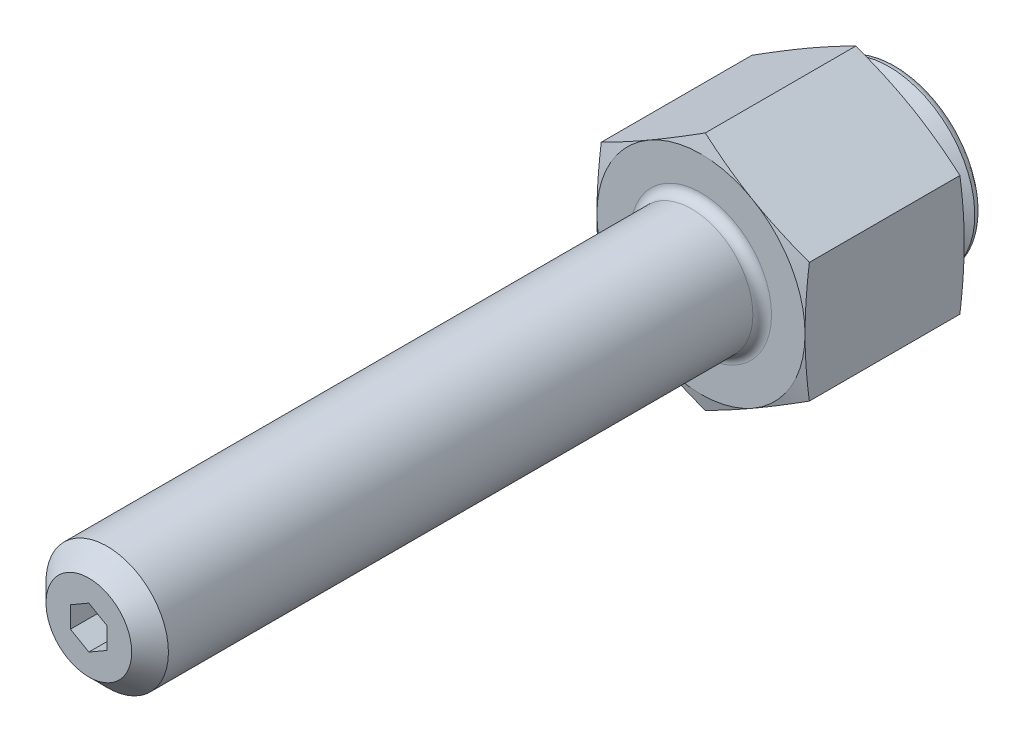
ISO-10303-21;
HEADER;
FILE_DESCRIPTION(('STEP AP214'),'2;1');
FILE_NAME('part.step','',(''),(''),'','','');
FILE_SCHEMA(('AUTOMOTIVE_DESIGN { 1 0 10303 214 1 1 1 1 }'));
ENDSEC;
DATA;
#1=APPLICATION_CONTEXT('core data for automotive mechanical design processes');
#2=APPLICATION_PROTOCOL_DEFINITION('international standard','automotive_design',2000,#1);
#3=PRODUCT_CONTEXT('',#1,'mechanical');
#4=PRODUCT('Part','Part','',(#3));
#5=PRODUCT_RELATED_PRODUCT_CATEGORY('part','',(#4));
#6=PRODUCT_DEFINITION_FORMATION('','',#4);
#7=PRODUCT_DEFINITION_CONTEXT('part definition',#1,'design');
#8=PRODUCT_DEFINITION('design','',#6,#7);
#9=PRODUCT_DEFINITION_SHAPE('','',#8);
#10=(LENGTH_UNIT() NAMED_UNIT(*) SI_UNIT(.MILLI.,.METRE.));
#11=(NAMED_UNIT(*) PLANE_ANGLE_UNIT() SI_UNIT($,.RADIAN.));
#12=(NAMED_UNIT(*) SI_UNIT($,.STERADIAN.) SOLID_ANGLE_UNIT());
#13=UNCERTAINTY_MEASURE_WITH_UNIT(LENGTH_MEASURE(1.E-05),#10,'distance_accuracy_value','');
#14=(GEOMETRIC_REPRESENTATION_CONTEXT(3) GLOBAL_UNCERTAINTY_ASSIGNED_CONTEXT((#13)) GLOBAL_UNIT_ASSIGNED_CONTEXT((#10,
#11,#12)) REPRESENTATION_CONTEXT('',''));
#15=CARTESIAN_POINT('',(0.,0.,0.));
#16=DIRECTION('',(0.,0.,1.));
#17=DIRECTION('',(1.,0.,0.));
#18=AXIS2_PLACEMENT_3D('',#15,#16,#17);
#19=CARTESIAN_POINT('',(0.,0.,6.3503999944));
#20=DIRECTION('',(0.,0.,-1.));
#21=DIRECTION('',(-0.279811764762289,0.96005488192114,0.));
#22=AXIS2_PLACEMENT_3D('',#19,#20,#21);
#23=SPHERICAL_SURFACE('',#22,6.5);
#24=CARTESIAN_POINT('',(0.,0.,4.0159999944));
#25=DIRECTION('',(0.,0.,-1.));
#26=DIRECTION('',(-0.96005488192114,-0.279811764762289,0.));
#27=AXIS2_PLACEMENT_3D('',#24,#25,#26);
#28=CIRCLE('',#27,6.06634788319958);
#29=CARTESIAN_POINT('',(-1.69743550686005,5.82402690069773,4.0159999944));
#30=VERTEX_POINT('',#29);
#31=EDGE_CURVE('E9',#30,#30,#28,.F.);
#32=CARTESIAN_POINT('',(0.,0.,2.88641592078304));
#33=DIRECTION('',(0.,0.,1.));
#34=DIRECTION('',(-0.279811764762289,0.96005488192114,0.));
#35=AXIS2_PLACEMENT_3D('',#32,#33,#34);
#36=CIRCLE('',#35,5.50007403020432);
#37=CARTESIAN_POINT('',(-1.5389854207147,5.28037292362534,2.88641592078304));
#38=VERTEX_POINT('',#37);
#39=EDGE_CURVE('E359',#38,#38,#36,.T.);
#40=CARTESIAN_POINT('',(-1.69743550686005,5.82402690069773,4.0159999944));
#41=CARTESIAN_POINT('',(-1.69611072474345,5.81948147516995,4.00369644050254));
#42=CARTESIAN_POINT('',(-1.69477546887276,5.81490011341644,3.99140729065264));
#43=CARTESIAN_POINT('',(-1.69208405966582,5.80566568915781,3.96685825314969));
#44=CARTESIAN_POINT('',(-1.69072790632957,5.80101262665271,3.95459836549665));
#45=CARTESIAN_POINT('',(-1.68799475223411,5.7916349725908,3.93010830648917));
#46=CARTESIAN_POINT('',(-1.6866177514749,5.786910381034,3.91787813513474));
#47=CARTESIAN_POINT('',(-1.68384295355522,5.77738984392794,3.89344796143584));
#48=CARTESIAN_POINT('',(-1.68244515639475,5.77259389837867,3.88124795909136));
#49=CARTESIAN_POINT('',(-1.67962881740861,5.76293083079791,3.85687857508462));
#50=CARTESIAN_POINT('',(-1.67821027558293,5.75806370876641,3.84470919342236));
#51=CARTESIAN_POINT('',(-1.67535249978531,5.74825846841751,3.82040150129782));
#52=CARTESIAN_POINT('',(-1.67391326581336,5.7433203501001,3.80826319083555));
#53=CARTESIAN_POINT('',(-1.67101415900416,5.73337329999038,3.78401809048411));
#54=CARTESIAN_POINT('',(-1.66955428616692,5.72836436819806,3.77191130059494));
#55=CARTESIAN_POINT('',(-1.66661395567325,5.71827587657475,3.74772968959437));
#56=CARTESIAN_POINT('',(-1.66513349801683,5.71319631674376,3.73565486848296));
#57=CARTESIAN_POINT('',(-1.66215205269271,5.70296675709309,3.71153764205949));
#58=CARTESIAN_POINT('',(-1.66065106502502,5.6978167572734,3.69949523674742));
#59=CARTESIAN_POINT('',(-1.65762861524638,5.68744650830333,3.67544328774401));
#60=CARTESIAN_POINT('',(-1.65610715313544,5.68222625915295,3.66343374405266));
#61=CARTESIAN_POINT('',(-1.65304381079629,5.6717157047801,3.63944796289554));
#62=CARTESIAN_POINT('',(-1.65150193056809,5.66642539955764,3.62747172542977));
#63=CARTESIAN_POINT('',(-1.6483978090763,5.65577492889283,3.60355300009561));
#64=CARTESIAN_POINT('',(-1.64683556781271,5.65041476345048,3.59161051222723));
#65=CARTESIAN_POINT('',(-1.64369078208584,5.63962477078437,3.56775972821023));
#66=CARTESIAN_POINT('',(-1.64210823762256,5.6341949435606,3.55585143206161));
#67=CARTESIAN_POINT('',(-1.63892290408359,5.62326582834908,3.53206947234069));
#68=CARTESIAN_POINT('',(-1.63732011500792,5.61776654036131,3.5201958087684));
#69=CARTESIAN_POINT('',(-1.63409435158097,5.60669870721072,3.49648355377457));
#70=CARTESIAN_POINT('',(-1.6324713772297,5.60113016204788,3.48464496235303));
#71=CARTESIAN_POINT('',(-1.62920530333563,5.58992402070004,3.46100328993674));
#72=CARTESIAN_POINT('',(-1.62756220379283,5.58428642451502,3.44920020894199));
#73=CARTESIAN_POINT('',(-1.62425594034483,5.57294238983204,3.42562999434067));
#74=CARTESIAN_POINT('',(-1.62259277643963,5.56723595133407,3.41386286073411));
#75=CARTESIAN_POINT('',(-1.61924644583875,5.55575444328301,3.39036497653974));
#76=CARTESIAN_POINT('',(-1.61756327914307,5.54997937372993,3.37863422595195));
#77=CARTESIAN_POINT('',(-1.61417700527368,5.53836081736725,3.35520954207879));
#78=CARTESIAN_POINT('',(-1.61247389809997,5.53251733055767,3.34351560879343));
#79=CARTESIAN_POINT('',(-1.60904780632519,5.5207621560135,3.32016499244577));
#80=CARTESIAN_POINT('',(-1.60732482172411,5.51485046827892,3.30850830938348));
#81=CARTESIAN_POINT('',(-1.60385903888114,5.50295911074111,3.28523262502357));
#82=CARTESIAN_POINT('',(-1.60211624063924,5.49697944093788,3.27361362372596));
#83=CARTESIAN_POINT('',(-1.59861089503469,5.48495234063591,3.25041373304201));
#84=CARTESIAN_POINT('',(-1.59684834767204,5.47890491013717,3.23883284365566));
#85=CARTESIAN_POINT('',(-1.59330356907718,5.46674251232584,3.2157096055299));
#86=CARTESIAN_POINT('',(-1.59152133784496,5.46062754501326,3.20416725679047));
#87=CARTESIAN_POINT('',(-1.5879372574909,5.44833029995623,3.18112152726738));
#88=CARTESIAN_POINT('',(-1.58613540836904,5.44214802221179,3.16961814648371));
#89=CARTESIAN_POINT('',(-1.58251215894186,5.42971638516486,3.14665077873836));
#90=CARTESIAN_POINT('',(-1.58069075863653,5.42346702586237,3.13518679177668));
#91=CARTESIAN_POINT('',(-1.57702847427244,5.41090145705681,3.112298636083));
#92=CARTESIAN_POINT('',(-1.57518759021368,5.40458524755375,3.100874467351));
#93=CARTESIAN_POINT('',(-1.57148640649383,5.39188621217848,3.07806637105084));
#94=CARTESIAN_POINT('',(-1.56962610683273,5.38550338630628,3.06668244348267));
#95=CARTESIAN_POINT('',(-1.56588616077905,5.37267135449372,3.04395525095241));
#96=CARTESIAN_POINT('',(-1.56400651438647,5.36622214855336,3.03261198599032));
#97=CARTESIAN_POINT('',(-1.56022794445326,5.35325759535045,3.00996653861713));
#98=CARTESIAN_POINT('',(-1.55832902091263,5.34674224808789,2.99866435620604));
#99=CARTESIAN_POINT('',(-1.55451196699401,5.33364565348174,2.97610149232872));
#100=CARTESIAN_POINT('',(-1.55259383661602,5.32706440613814,2.96484081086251));
#101=CARTESIAN_POINT('',(-1.54873843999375,5.31383625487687,2.94236136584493));
#102=CARTESIAN_POINT('',(-1.54680117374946,5.30718935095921,2.93114260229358));
#103=CARTESIAN_POINT('',(-1.5429075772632,5.29383013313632,2.90874740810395));
#104=CARTESIAN_POINT('',(-1.54095124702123,5.2871178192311,2.89757097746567));
#105=CARTESIAN_POINT('',(-1.5389854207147,5.28037292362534,2.88641592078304));
#106=B_SPLINE_CURVE_WITH_KNOTS('',3,(#40,#41,#42,#43,#44,#45,#46,#47,#48,#49,#50,#51,#52,#53,
#54,#55,#56,#57,#58,#59,#60,#61,#62,#63,#64,#65,#66,#67,#68,#69,#70,#71,#72,#73,#74,#75,#76,#77,
#78,#79,#80,#81,#82,#83,#84,#85,#86,#87,#88,#89,#90,#91,#92,#93,#94,#95,#96,#97,#98,#99,#100,
#101,#102,#103,#104,#105),.UNSPECIFIED.,.F.,.F.,(4,2,2,2,2,2,2,2,2,2,2,2,2,2,2,2,2,2,2,2,2,2,2,
2,2,2,2,2,2,2,2,2,4),(0.,0.0395491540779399,0.0790983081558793,0.118647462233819,
0.15819661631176,0.1977457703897,0.23729492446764,0.27684407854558,0.31639323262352,
0.35594238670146,0.3954915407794,0.43504069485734,0.47458984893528,0.51413900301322,
0.55368815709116,0.5932373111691,0.63278646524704,0.672335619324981,0.71188477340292,
0.751433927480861,0.7909830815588,0.83053223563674,0.87008138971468,0.90963054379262,
0.949179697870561,0.988728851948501,1.02827800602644,1.06782716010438,1.10737631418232,
1.14692546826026,1.1864746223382,1.22602377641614,1.26557293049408),.UNSPECIFIED.);
#107=EDGE_CURVE('BSEAM14',#30,#38,#106,.T.);
#108=ORIENTED_EDGE('',*,*,#31,.F.);
#109=ORIENTED_EDGE('',*,*,#39,.T.);
#110=ORIENTED_EDGE('',*,*,#107,.T.);
#111=ORIENTED_EDGE('',*,*,#107,.F.);
#112=EDGE_LOOP('',(#108,#110,#109,#111));
#113=FACE_BOUND('',#112,.T.);
#114=ADVANCED_FACE('F14',(#113),#23,.T.);
#115=CARTESIAN_POINT('',(0.,0.,0.));
#116=DIRECTION('',(0.,0.,-1.));
#117=DIRECTION('',(0.279811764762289,-0.96005488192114,0.));
#118=AXIS2_PLACEMENT_3D('',#115,#116,#117);
#119=CYLINDRICAL_SURFACE('',#118,5.461);
#120=CARTESIAN_POINT('',(0.,0.,2.75105408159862));
#121=DIRECTION('',(0.,0.,1.));
#122=DIRECTION('',(-0.279811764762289,0.96005488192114,0.));
#123=AXIS2_PLACEMENT_3D('',#120,#121,#122);
#124=CIRCLE('',#123,5.461);
#125=CARTESIAN_POINT('',(-1.52805204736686,5.24285971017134,2.75105408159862));
#126=VERTEX_POINT('',#125);
#127=EDGE_CURVE('E357',#126,#126,#124,.F.);
#128=ORIENTED_EDGE('',*,*,#127,.T.);
#129=EDGE_LOOP('',(#128));
#130=FACE_BOUND('',#129,.T.);
#131=CARTESIAN_POINT('',(0.,0.,1.670189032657));
#132=DIRECTION('',(0.,0.,-1.));
#133=DIRECTION('',(0.279811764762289,-0.96005488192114,0.));
#134=AXIS2_PLACEMENT_3D('',#131,#132,#133);
#135=CIRCLE('',#134,5.461);
#136=CARTESIAN_POINT('',(1.52805204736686,-5.24285971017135,1.670189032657));
#137=VERTEX_POINT('',#136);
#138=EDGE_CURVE('E354',#137,#137,#135,.F.);
#139=ORIENTED_EDGE('',*,*,#138,.T.);
#140=EDGE_LOOP('',(#139));
#141=FACE_BOUND('',#140,.T.);
#142=ADVANCED_FACE('F378',(#130,#141),#119,.T.);
#143=CARTESIAN_POINT('',(0.,0.,1.52354206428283));
#144=DIRECTION('',(0.,0.,-1.));
#145=DIRECTION('',(0.279811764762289,-0.96005488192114,0.));
#146=AXIS2_PLACEMENT_3D('',#143,#144,#145);
#147=CONICAL_SURFACE('',#146,5.461,1.0471975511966);
#148=CARTESIAN_POINT('',(0.,0.,1.45021858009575));
#149=DIRECTION('',(0.,0.,-1.));
#150=DIRECTION('',(0.279811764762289,-0.96005488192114,0.));
#151=AXIS2_PLACEMENT_3D('',#148,#149,#150);
#152=CIRCLE('',#151,5.588);
#153=CARTESIAN_POINT('',(1.56358814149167,-5.36478668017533,1.45021858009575));
#154=VERTEX_POINT('',#153);
#155=EDGE_CURVE('E18',#154,#154,#152,.T.);
#156=ORIENTED_EDGE('',*,*,#155,.T.);
#157=EDGE_LOOP('',(#156));
#158=FACE_BOUND('',#157,.T.);
#159=CARTESIAN_POINT('',(0.,0.,0.635));
#160=DIRECTION('',(0.,0.,-1.));
#161=DIRECTION('',(0.279811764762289,-0.96005488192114,0.));
#162=AXIS2_PLACEMENT_3D('',#159,#160,#161);
#163=CIRCLE('',#162,7.);
#164=CARTESIAN_POINT('',(1.95868235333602,-6.72038417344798,0.635));
#165=VERTEX_POINT('',#164);
#166=EDGE_CURVE('E348',#165,#165,#163,.T.);
#167=ORIENTED_EDGE('',*,*,#166,.F.);
#168=EDGE_LOOP('',(#167));
#169=FACE_BOUND('',#168,.T.);
#170=ADVANCED_FACE('F384',(#158,#169),#147,.T.);
#171=CARTESIAN_POINT('',(-1.95868235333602,6.72038417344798,0.));
#172=DIRECTION('',(0.,0.,1.));
#173=DIRECTION('',(-0.279811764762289,0.96005488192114,0.));
#174=AXIS2_PLACEMENT_3D('',#171,#172,#173);
#175=PLANE('',#174);
#176=CARTESIAN_POINT('',(0.,0.,0.));
#177=DIRECTION('',(0.,0.,1.));
#178=DIRECTION('',(-0.279811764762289,0.96005488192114,0.));
#179=AXIS2_PLACEMENT_3D('',#176,#177,#178);
#180=CIRCLE('',#179,6.365);
#181=CARTESIAN_POINT('',(-1.78100188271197,6.11074932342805,0.));
#182=VERTEX_POINT('',#181);
#183=EDGE_CURVE('E351',#182,#182,#180,.F.);
#184=ORIENTED_EDGE('',*,*,#183,.T.);
#185=EDGE_LOOP('',(#184));
#186=FACE_BOUND('',#185,.T.);
#187=ADVANCED_FACE('F444',(#186),#175,.F.);
#188=CARTESIAN_POINT('',(0.,0.,0.635));
#189=DIRECTION('',(0.,0.,1.));
#190=DIRECTION('',(-0.279811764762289,0.96005488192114,0.));
#191=AXIS2_PLACEMENT_3D('',#188,#189,#190);
#192=TOROIDAL_SURFACE('',#191,6.365,0.635);
#193=ORIENTED_EDGE('',*,*,#166,.T.);
#194=EDGE_LOOP('',(#193));
#195=FACE_BOUND('',#194,.T.);
#196=ORIENTED_EDGE('',*,*,#183,.F.);
#197=EDGE_LOOP('',(#196));
#198=FACE_BOUND('',#197,.T.);
#199=ADVANCED_FACE('F447',(#195,#198),#192,.T.);
#200=CARTESIAN_POINT('',(0.,0.,2.75105408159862));
#201=DIRECTION('',(0.,0.,1.));
#202=DIRECTION('',(-0.279811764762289,0.96005488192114,0.));
#203=AXIS2_PLACEMENT_3D('',#200,#201,#202);
#204=TOROIDAL_SURFACE('',#203,5.715,0.254);
#205=ORIENTED_EDGE('',*,*,#39,.F.);
#206=EDGE_LOOP('',(#205));
#207=FACE_BOUND('',#206,.T.);
#208=ORIENTED_EDGE('',*,*,#127,.F.);
#209=EDGE_LOOP('',(#208));
#210=FACE_BOUND('',#209,.T.);
#211=ADVANCED_FACE('F396',(#207,#210),#204,.F.);
#212=CARTESIAN_POINT('',(0.,0.,1.670189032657));
#213=DIRECTION('',(0.,0.,-1.));
#214=DIRECTION('',(0.279811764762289,-0.96005488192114,0.));
#215=AXIS2_PLACEMENT_3D('',#212,#213,#214);
#216=TOROIDAL_SURFACE('',#215,5.715,0.254);
#217=ORIENTED_EDGE('',*,*,#138,.F.);
#218=EDGE_LOOP('',(#217));
#219=FACE_BOUND('',#218,.T.);
#220=ORIENTED_EDGE('',*,*,#155,.F.);
#221=EDGE_LOOP('',(#220));
#222=FACE_BOUND('',#221,.T.);
#223=ADVANCED_FACE('F16',(#219,#222),#216,.F.);
#224=CARTESIAN_POINT('',(3.,0.,61.9999999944));
#225=DIRECTION('',(0.,0.,-1.));
#226=DIRECTION('',(-1.,0.,0.));
#227=AXIS2_PLACEMENT_3D('',#224,#225,#226);
#228=PLANE('',#227);
#229=DIRECTION('',(-0.866025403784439,0.5,0.));
#230=VECTOR('',#229,1.);
#231=CARTESIAN_POINT('',(1.5,0.86602540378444,61.9999999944));
#232=LINE('',#231,#230);
#233=CARTESIAN_POINT('',(1.5,0.86602540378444,61.9999999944));
#234=VERTEX_POINT('',#233);
#235=CARTESIAN_POINT('',(0.,1.73205080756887,61.9999999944));
#236=VERTEX_POINT('',#235);
#237=EDGE_CURVE('E144',#234,#236,#232,.T.);
#238=ORIENTED_EDGE('',*,*,#237,.T.);
#239=DIRECTION('',(-0.866025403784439,-0.5,0.));
#240=VECTOR('',#239,1.);
#241=CARTESIAN_POINT('',(0.,1.73205080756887,61.9999999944));
#242=LINE('',#241,#240);
#243=CARTESIAN_POINT('',(-1.5,0.866025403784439,61.9999999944));
#244=VERTEX_POINT('',#243);
#245=EDGE_CURVE('E153',#236,#244,#242,.T.);
#246=ORIENTED_EDGE('',*,*,#245,.T.);
#247=DIRECTION('',(0.,-1.,0.));
#248=VECTOR('',#247,1.);
#249=CARTESIAN_POINT('',(-1.5,0.866025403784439,61.9999999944));
#250=LINE('',#249,#248);
#251=CARTESIAN_POINT('',(-1.5,-0.86602540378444,61.9999999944));
#252=VERTEX_POINT('',#251);
#253=EDGE_CURVE('E158',#244,#252,#250,.T.);
#254=ORIENTED_EDGE('',*,*,#253,.T.);
#255=DIRECTION('',(0.866025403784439,-0.5,0.));
#256=VECTOR('',#255,1.);
#257=CARTESIAN_POINT('',(-1.5,-0.86602540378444,61.9999999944));
#258=LINE('',#257,#256);
#259=CARTESIAN_POINT('',(0.,-1.73205080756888,61.9999999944));
#260=VERTEX_POINT('',#259);
#261=EDGE_CURVE('E172',#252,#260,#258,.T.);
#262=ORIENTED_EDGE('',*,*,#261,.T.);
#263=DIRECTION('',(0.866025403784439,0.5,0.));
#264=VECTOR('',#263,1.);
#265=CARTESIAN_POINT('',(0.,-1.73205080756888,61.9999999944));
#266=LINE('',#265,#264);
#267=CARTESIAN_POINT('',(1.5,-0.866025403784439,61.9999999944));
#268=VERTEX_POINT('',#267);
#269=EDGE_CURVE('E175',#260,#268,#266,.T.);
#270=ORIENTED_EDGE('',*,*,#269,.T.);
#271=DIRECTION('',(0.,1.,0.));
#272=VECTOR('',#271,1.);
#273=CARTESIAN_POINT('',(1.5,-0.866025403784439,61.9999999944));
#274=LINE('',#273,#272);
#275=EDGE_CURVE('E150',#268,#234,#274,.T.);
#276=ORIENTED_EDGE('',*,*,#275,.T.);
#277=EDGE_LOOP('',(#238,#246,#254,#262,#270,#276));
#278=FACE_BOUND('',#277,.T.);
#279=ADVANCED_FACE('F160',(#278),#228,.F.);
#280=CARTESIAN_POINT('',(0.,1.73205080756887,61.9999999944));
#281=DIRECTION('',(-0.5,0.866025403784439,0.));
#282=DIRECTION('',(0.866025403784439,0.5,0.));
#283=AXIS2_PLACEMENT_3D('',#280,#281,#282);
#284=PLANE('',#283);
#285=DIRECTION('',(-0.866025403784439,-0.5,0.));
#286=VECTOR('',#285,1.);
#287=CARTESIAN_POINT('',(0.,1.73205080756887,65.9999999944));
#288=LINE('',#287,#286);
#289=CARTESIAN_POINT('',(0.,1.73205080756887,65.9999999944));
#290=VERTEX_POINT('',#289);
#291=CARTESIAN_POINT('',(-1.5,0.866025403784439,65.9999999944));
#292=VERTEX_POINT('',#291);
#293=EDGE_CURVE('E179',#290,#292,#288,.T.);
#294=ORIENTED_EDGE('',*,*,#293,.T.);
#295=DIRECTION('',(0.,0.,1.));
#296=VECTOR('',#295,1.);
#297=CARTESIAN_POINT('',(-1.5,0.866025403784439,61.9999999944));
#298=LINE('',#297,#296);
#299=EDGE_CURVE('E149',#244,#292,#298,.T.);
#300=ORIENTED_EDGE('',*,*,#299,.F.);
#301=ORIENTED_EDGE('',*,*,#245,.F.);
#302=DIRECTION('',(0.,0.,1.));
#303=VECTOR('',#302,1.);
#304=CARTESIAN_POINT('',(0.,1.73205080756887,61.9999999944));
#305=LINE('',#304,#303);
#306=EDGE_CURVE('E140',#236,#290,#305,.T.);
#307=ORIENTED_EDGE('',*,*,#306,.T.);
#308=EDGE_LOOP('',(#294,#300,#301,#307));
#309=FACE_BOUND('',#308,.T.);
#310=ADVANCED_FACE('F154',(#309),#284,.F.);
#311=CARTESIAN_POINT('',(-1.5,0.866025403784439,61.9999999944));
#312=DIRECTION('',(-1.,0.,0.));
#313=DIRECTION('',(0.,1.,0.));
#314=AXIS2_PLACEMENT_3D('',#311,#312,#313);
#315=PLANE('',#314);
#316=DIRECTION('',(0.,-1.,0.));
#317=VECTOR('',#316,1.);
#318=CARTESIAN_POINT('',(-1.5,0.866025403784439,65.9999999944));
#319=LINE('',#318,#317);
#320=CARTESIAN_POINT('',(-1.5,-0.86602540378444,65.9999999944));
#321=VERTEX_POINT('',#320);
#322=EDGE_CURVE('E181',#292,#321,#319,.T.);
#323=ORIENTED_EDGE('',*,*,#322,.T.);
#324=DIRECTION('',(0.,0.,1.));
#325=VECTOR('',#324,1.);
#326=CARTESIAN_POINT('',(-1.5,-0.86602540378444,61.9999999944));
#327=LINE('',#326,#325);
#328=EDGE_CURVE('E196',#252,#321,#327,.T.);
#329=ORIENTED_EDGE('',*,*,#328,.F.);
#330=ORIENTED_EDGE('',*,*,#253,.F.);
#331=ORIENTED_EDGE('',*,*,#299,.T.);
#332=EDGE_LOOP('',(#323,#329,#330,#331));
#333=FACE_BOUND('',#332,.T.);
#334=ADVANCED_FACE('F394',(#333),#315,.F.);
#335=CARTESIAN_POINT('',(-1.5,-0.86602540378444,61.9999999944));
#336=DIRECTION('',(-0.5,-0.866025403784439,0.));
#337=DIRECTION('',(-0.866025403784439,0.5,0.));
#338=AXIS2_PLACEMENT_3D('',#335,#336,#337);
#339=PLANE('',#338);
#340=DIRECTION('',(0.866025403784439,-0.5,0.));
#341=VECTOR('',#340,1.);
#342=CARTESIAN_POINT('',(-1.5,-0.86602540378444,65.9999999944));
#343=LINE('',#342,#341);
#344=CARTESIAN_POINT('',(0.,-1.73205080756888,65.9999999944));
#345=VERTEX_POINT('',#344);
#346=EDGE_CURVE('E184',#321,#345,#343,.T.);
#347=ORIENTED_EDGE('',*,*,#346,.T.);
#348=DIRECTION('',(0.,0.,1.));
#349=VECTOR('',#348,1.);
#350=CARTESIAN_POINT('',(0.,-1.73205080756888,61.9999999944));
#351=LINE('',#350,#349);
#352=EDGE_CURVE('E194',#260,#345,#351,.T.);
#353=ORIENTED_EDGE('',*,*,#352,.F.);
#354=ORIENTED_EDGE('',*,*,#261,.F.);
#355=ORIENTED_EDGE('',*,*,#328,.T.);
#356=EDGE_LOOP('',(#347,#353,#354,#355));
#357=FACE_BOUND('',#356,.T.);
#358=ADVANCED_FACE('F406',(#357),#339,.F.);
#359=CARTESIAN_POINT('',(0.,-1.73205080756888,61.9999999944));
#360=DIRECTION('',(0.5,-0.866025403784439,0.));
#361=DIRECTION('',(-0.866025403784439,-0.5,0.));
#362=AXIS2_PLACEMENT_3D('',#359,#360,#361);
#363=PLANE('',#362);
#364=DIRECTION('',(0.866025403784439,0.5,0.));
#365=VECTOR('',#364,1.);
#366=CARTESIAN_POINT('',(0.,-1.73205080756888,65.9999999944));
#367=LINE('',#366,#365);
#368=CARTESIAN_POINT('',(1.5,-0.866025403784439,65.9999999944));
#369=VERTEX_POINT('',#368);
#370=EDGE_CURVE('E166',#345,#369,#367,.T.);
#371=ORIENTED_EDGE('',*,*,#370,.T.);
#372=DIRECTION('',(0.,0.,1.));
#373=VECTOR('',#372,1.);
#374=CARTESIAN_POINT('',(1.5,-0.866025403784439,61.9999999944));
#375=LINE('',#374,#373);
#376=EDGE_CURVE('E192',#268,#369,#375,.T.);
#377=ORIENTED_EDGE('',*,*,#376,.F.);
#378=ORIENTED_EDGE('',*,*,#269,.F.);
#379=ORIENTED_EDGE('',*,*,#352,.T.);
#380=EDGE_LOOP('',(#371,#377,#378,#379));
#381=FACE_BOUND('',#380,.T.);
#382=ADVANCED_FACE('F402',(#381),#363,.F.);
#383=CARTESIAN_POINT('',(1.5,-0.866025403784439,61.9999999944));
#384=DIRECTION('',(1.,0.,0.));
#385=DIRECTION('',(0.,-1.,0.));
#386=AXIS2_PLACEMENT_3D('',#383,#384,#385);
#387=PLANE('',#386);
#388=DIRECTION('',(0.,1.,0.));
#389=VECTOR('',#388,1.);
#390=CARTESIAN_POINT('',(1.5,-0.866025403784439,65.9999999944));
#391=LINE('',#390,#389);
#392=CARTESIAN_POINT('',(1.5,0.86602540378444,65.9999999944));
#393=VERTEX_POINT('',#392);
#394=EDGE_CURVE('E163',#369,#393,#391,.T.);
#395=ORIENTED_EDGE('',*,*,#394,.T.);
#396=DIRECTION('',(0.,0.,1.));
#397=VECTOR('',#396,1.);
#398=CARTESIAN_POINT('',(1.5,0.86602540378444,61.9999999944));
#399=LINE('',#398,#397);
#400=EDGE_CURVE('E189',#234,#393,#399,.T.);
#401=ORIENTED_EDGE('',*,*,#400,.F.);
#402=ORIENTED_EDGE('',*,*,#275,.F.);
#403=ORIENTED_EDGE('',*,*,#376,.T.);
#404=EDGE_LOOP('',(#395,#401,#402,#403));
#405=FACE_BOUND('',#404,.T.);
#406=ADVANCED_FACE('F399',(#405),#387,.F.);
#407=CARTESIAN_POINT('',(1.5,0.86602540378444,61.9999999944));
#408=DIRECTION('',(0.5,0.866025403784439,0.));
#409=DIRECTION('',(0.866025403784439,-0.5,0.));
#410=AXIS2_PLACEMENT_3D('',#407,#408,#409);
#411=PLANE('',#410);
#412=DIRECTION('',(-0.866025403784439,0.5,0.));
#413=VECTOR('',#412,1.);
#414=CARTESIAN_POINT('',(1.5,0.86602540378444,65.9999999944));
#415=LINE('',#414,#413);
#416=EDGE_CURVE('E31',#393,#290,#415,.T.);
#417=ORIENTED_EDGE('',*,*,#416,.T.);
#418=ORIENTED_EDGE('',*,*,#306,.F.);
#419=ORIENTED_EDGE('',*,*,#237,.F.);
#420=ORIENTED_EDGE('',*,*,#400,.T.);
#421=EDGE_LOOP('',(#417,#418,#419,#420));
#422=FACE_BOUND('',#421,.T.);
#423=ADVANCED_FACE('F142',(#422),#411,.F.);
#424=CARTESIAN_POINT('',(0.,0.,65.9999999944));
#425=DIRECTION('',(0.,0.,1.));
#426=DIRECTION('',(1.,0.,0.));
#427=AXIS2_PLACEMENT_3D('',#424,#425,#426);
#428=PLANE('',#427);
#429=ORIENTED_EDGE('',*,*,#416,.F.);
#430=ORIENTED_EDGE('',*,*,#394,.F.);
#431=ORIENTED_EDGE('',*,*,#370,.F.);
#432=ORIENTED_EDGE('',*,*,#346,.F.);
#433=ORIENTED_EDGE('',*,*,#322,.F.);
#434=ORIENTED_EDGE('',*,*,#293,.F.);
#435=EDGE_LOOP('',(#429,#430,#431,#432,#433,#434));
#436=FACE_BOUND('',#435,.T.);
#437=CARTESIAN_POINT('',(0.,0.,65.9999999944));
#438=DIRECTION('',(0.,0.,1.));
#439=DIRECTION('',(1.,0.,0.));
#440=AXIS2_PLACEMENT_3D('',#437,#438,#439);
#441=CIRCLE('',#440,3.5);
#442=CARTESIAN_POINT('',(3.49999999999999,0.,65.9999999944));
#443=VERTEX_POINT('',#442);
#444=EDGE_CURVE('E343',#443,#443,#441,.T.);
#445=ORIENTED_EDGE('',*,*,#444,.T.);
#446=EDGE_LOOP('',(#445));
#447=FACE_BOUND('',#446,.T.);
#448=ADVANCED_FACE('F416',(#436,#447),#428,.T.);
#449=CARTESIAN_POINT('',(0.,0.,65.9999999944));
#450=DIRECTION('',(0.,0.,-1.));
#451=DIRECTION('',(-1.,0.,0.));
#452=AXIS2_PLACEMENT_3D('',#449,#450,#451);
#453=CONICAL_SURFACE('',#452,3.5,0.785398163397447);
#454=CARTESIAN_POINT('',(0.,0.,64.4999999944));
#455=DIRECTION('',(0.,0.,1.));
#456=DIRECTION('',(1.,0.,0.));
#457=AXIS2_PLACEMENT_3D('',#454,#455,#456);
#458=CIRCLE('',#457,5.);
#459=CARTESIAN_POINT('',(4.99999999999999,0.,64.4999999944));
#460=VERTEX_POINT('',#459);
#461=EDGE_CURVE('E23',#460,#460,#458,.F.);
#462=ORIENTED_EDGE('',*,*,#461,.F.);
#463=EDGE_LOOP('',(#462));
#464=FACE_BOUND('',#463,.T.);
#465=ORIENTED_EDGE('',*,*,#444,.F.);
#466=EDGE_LOOP('',(#465));
#467=FACE_BOUND('',#466,.T.);
#468=ADVANCED_FACE('F418',(#464,#467),#453,.T.);
#469=CARTESIAN_POINT('',(0.,0.,65.9999999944));
#470=DIRECTION('',(0.,0.,-1.));
#471=DIRECTION('',(-1.,0.,0.));
#472=AXIS2_PLACEMENT_3D('',#469,#470,#471);
#473=CYLINDRICAL_SURFACE('',#472,5.);
#474=ORIENTED_EDGE('',*,*,#461,.T.);
#475=EDGE_LOOP('',(#474));
#476=FACE_BOUND('',#475,.T.);
#477=CARTESIAN_POINT('',(0.,0.,16.7619999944));
#478=DIRECTION('',(0.,0.,1.));
#479=DIRECTION('',(1.,0.,0.));
#480=AXIS2_PLACEMENT_3D('',#477,#478,#479);
#481=CIRCLE('',#480,5.);
#482=CARTESIAN_POINT('',(5.,0.,16.7619999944));
#483=VERTEX_POINT('',#482);
#484=EDGE_CURVE('E337',#483,#483,#481,.T.);
#485=ORIENTED_EDGE('',*,*,#484,.T.);
#486=EDGE_LOOP('',(#485));
#487=FACE_BOUND('',#486,.T.);
#488=ADVANCED_FACE('F420',(#476,#487),#473,.T.);
#489=CARTESIAN_POINT('',(0.,0.,16.7619999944));
#490=DIRECTION('',(0.,0.,1.));
#491=DIRECTION('',(1.,0.,0.));
#492=AXIS2_PLACEMENT_3D('',#489,#490,#491);
#493=TOROIDAL_SURFACE('',#492,5.762,0.762);
#494=CARTESIAN_POINT('',(0.,0.,15.9999999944));
#495=DIRECTION('',(0.,0.,1.));
#496=DIRECTION('',(1.,0.,0.));
#497=AXIS2_PLACEMENT_3D('',#494,#495,#496);
#498=CIRCLE('',#497,5.762);
#499=CARTESIAN_POINT('',(5.762,0.,15.9999999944));
#500=VERTEX_POINT('',#499);
#501=EDGE_CURVE('E340',#500,#500,#498,.F.);
#502=ORIENTED_EDGE('',*,*,#501,.F.);
#503=EDGE_LOOP('',(#502));
#504=FACE_BOUND('',#503,.T.);
#505=ORIENTED_EDGE('',*,*,#484,.F.);
#506=EDGE_LOOP('',(#505));
#507=FACE_BOUND('',#506,.T.);
#508=ADVANCED_FACE('F422',(#504,#507),#493,.F.);
#509=CARTESIAN_POINT('',(-8.5,-4.90747728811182,15.9999999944));
#510=DIRECTION('',(0.,0.,1.));
#511=DIRECTION('',(1.,0.,0.));
#512=AXIS2_PLACEMENT_3D('',#509,#510,#511);
#513=PLANE('',#512);
#514=CARTESIAN_POINT('',(0.,0.,15.9999999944));
#515=DIRECTION('',(0.,0.,1.));
#516=DIRECTION('',(1.,0.,0.));
#517=AXIS2_PLACEMENT_3D('',#514,#515,#516);
#518=CIRCLE('',#517,8.5);
#519=CARTESIAN_POINT('',(4.25,-7.36121593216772,15.9999999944));
#520=VERTEX_POINT('',#519);
#521=CARTESIAN_POINT('',(8.5,0.,15.9999999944));
#522=VERTEX_POINT('',#521);
#523=EDGE_CURVE('E306',#520,#522,#518,.T.);
#524=ORIENTED_EDGE('',*,*,#523,.T.);
#525=CARTESIAN_POINT('',(4.25,7.36121593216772,15.9999999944));
#526=VERTEX_POINT('',#525);
#527=EDGE_CURVE('E325',#522,#526,#518,.T.);
#528=ORIENTED_EDGE('',*,*,#527,.T.);
#529=CARTESIAN_POINT('',(-4.25,7.36121593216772,15.9999999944));
#530=VERTEX_POINT('',#529);
#531=EDGE_CURVE('E824',#526,#530,#518,.T.);
#532=ORIENTED_EDGE('',*,*,#531,.T.);
#533=CARTESIAN_POINT('',(0.,0.,15.9999999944));
#534=DIRECTION('',(0.,0.,-1.));
#535=DIRECTION('',(-1.,0.,0.));
#536=AXIS2_PLACEMENT_3D('',#533,#534,#535);
#537=CIRCLE('',#536,8.5);
#538=CARTESIAN_POINT('',(-8.5,0.,15.9999999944));
#539=VERTEX_POINT('',#538);
#540=EDGE_CURVE('E788',#539,#530,#537,.T.);
#541=ORIENTED_EDGE('',*,*,#540,.F.);
#542=CARTESIAN_POINT('',(-4.25,-7.36121593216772,15.9999999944));
#543=VERTEX_POINT('',#542);
#544=EDGE_CURVE('E826',#539,#543,#518,.T.);
#545=ORIENTED_EDGE('',*,*,#544,.T.);
#546=EDGE_CURVE('E324',#543,#520,#518,.T.);
#547=ORIENTED_EDGE('',*,*,#546,.T.);
#548=EDGE_LOOP('',(#524,#528,#532,#541,#545,#547));
#549=FACE_BOUND('',#548,.T.);
#550=ORIENTED_EDGE('',*,*,#501,.T.);
#551=EDGE_LOOP('',(#550));
#552=FACE_BOUND('',#551,.T.);
#553=ADVANCED_FACE('F428',(#549,#552),#513,.T.);
#554=CARTESIAN_POINT('',(0.,0.,14.5858363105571));
#555=DIRECTION('',(0.,0.,-1.));
#556=DIRECTION('',(-1.,0.,0.));
#557=AXIS2_PLACEMENT_3D('',#554,#555,#556);
#558=CONICAL_SURFACE('',#557,13.7777307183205,1.30899693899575);
#559=ORIENTED_EDGE('',*,*,#540,.T.);
#560=CARTESIAN_POINT('',(-8.5002,4.90736181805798,15.6476280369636));
#561=CARTESIAN_POINT('',(-8.14719977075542,5.11116659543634,15.7022599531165));
#562=CARTESIAN_POINT('',(-7.7935595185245,5.31534089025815,15.7518566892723));
#563=CARTESIAN_POINT('',(-7.08503012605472,5.72441052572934,15.8389934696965));
#564=CARTESIAN_POINT('',(-6.73014053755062,5.92930612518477,15.8765286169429));
#565=CARTESIAN_POINT('',(-6.02126413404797,6.3385761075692,15.9373509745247));
#566=CARTESIAN_POINT('',(-5.66728211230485,6.54294772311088,15.9607107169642));
#567=CARTESIAN_POINT('',(-4.95886665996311,6.95195157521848,15.9920337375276));
#568=CARTESIAN_POINT('',(-4.60443332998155,7.1565837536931,15.9999999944));
#569=CARTESIAN_POINT('',(-3.89556667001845,7.56584811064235,15.9999999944));
#570=CARTESIAN_POINT('',(-3.5411333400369,7.77048028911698,15.9920337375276));
#571=CARTESIAN_POINT('',(-2.83271788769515,8.17948414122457,15.9607107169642));
#572=CARTESIAN_POINT('',(-2.47873586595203,8.38385575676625,15.9373509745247));
#573=CARTESIAN_POINT('',(-1.76985946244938,8.79312573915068,15.8765286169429));
#574=CARTESIAN_POINT('',(-1.41496987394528,8.99802133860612,15.8389934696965));
#575=CARTESIAN_POINT('',(-0.706440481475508,9.4070909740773,15.7518566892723));
#576=CARTESIAN_POINT('',(-0.35280022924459,9.61126526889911,15.7022599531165));
#577=CARTESIAN_POINT('',(0.000199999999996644,9.81507004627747,15.6476280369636));
#578=B_SPLINE_CURVE_WITH_KNOTS('',3,(#560,#561,#562,#563,#564,#565,#566,#567,#568,#569,#570,
#571,#572,#573,#574,#575,#576,#577),.UNSPECIFIED.,.F.,.F.,(4,2,2,2,2,2,2,2,4),(0.,
1.23382789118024,2.46815608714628,3.69611406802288,4.92383440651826,6.15155474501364,
7.37951272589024,8.61384092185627,9.84766881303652),.UNSPECIFIED.);
#579=CARTESIAN_POINT('',(-8.5,4.90747728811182,15.6476589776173));
#580=VERTEX_POINT('',#579);
#581=EDGE_CURVE('E776',#580,#530,#578,.T.);
#582=ORIENTED_EDGE('',*,*,#581,.F.);
#583=CARTESIAN_POINT('',(-8.5,-13.0512816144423,14.1042136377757));
#584=CARTESIAN_POINT('',(-8.5,-12.6648584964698,14.1909538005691));
#585=CARTESIAN_POINT('',(-8.5,-12.2781955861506,14.2766446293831));
#586=CARTESIAN_POINT('',(-8.5,-11.5042722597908,14.4453610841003));
#587=CARTESIAN_POINT('',(-8.5,-11.1170118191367,14.5283865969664));
#588=CARTESIAN_POINT('',(-8.5,-10.3414386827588,14.6912760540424));
#589=CARTESIAN_POINT('',(-8.5,-9.95312533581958,14.7711369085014));
#590=CARTESIAN_POINT('',(-8.5,-9.17569540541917,14.9268461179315));
#591=CARTESIAN_POINT('',(-8.5,-8.78657882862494,15.0026945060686));
#592=CARTESIAN_POINT('',(-8.5,-8.01051094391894,15.1488360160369));
#593=CARTESIAN_POINT('',(-8.5,-7.62356710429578,15.2191686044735));
#594=CARTESIAN_POINT('',(-8.5,-6.84862784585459,15.3537690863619));
#595=CARTESIAN_POINT('',(-8.5,-6.46063245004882,15.4180371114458));
#596=CARTESIAN_POINT('',(-8.5,-5.68350619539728,15.5390761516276));
#597=CARTESIAN_POINT('',(-8.5,-5.29437546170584,15.5958479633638));
#598=CARTESIAN_POINT('',(-8.5,-4.51487354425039,15.7002342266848));
#599=CARTESIAN_POINT('',(-8.5,-4.12450235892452,15.7478486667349));
#600=CARTESIAN_POINT('',(-8.5,-3.33808456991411,15.832587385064));
#601=CARTESIAN_POINT('',(-8.5,-2.94202415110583,15.8695853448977));
#602=CARTESIAN_POINT('',(-8.5,-2.14889276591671,15.9305478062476));
#603=CARTESIAN_POINT('',(-8.5,-1.75182182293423,15.9545126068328));
#604=CARTESIAN_POINT('',(-8.5,-0.957247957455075,15.988011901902));
#605=CARTESIAN_POINT('',(-8.5,-0.559745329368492,15.9975532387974));
#606=CARTESIAN_POINT('',(-8.5,0.23533764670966,16.0016174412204));
#607=CARTESIAN_POINT('',(-8.5,0.632917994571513,15.9961403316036));
#608=CARTESIAN_POINT('',(-8.5,1.42906314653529,15.9704744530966));
#609=CARTESIAN_POINT('',(-8.5,1.82762616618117,15.9502314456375));
#610=CARTESIAN_POINT('',(-8.5,2.62382411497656,15.8961949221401));
#611=CARTESIAN_POINT('',(-8.5,3.02145902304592,15.8624011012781));
#612=CARTESIAN_POINT('',(-8.5,3.81579650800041,15.7829870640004));
#613=CARTESIAN_POINT('',(-8.50000000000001,4.2124982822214,15.7373589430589));
#614=CARTESIAN_POINT('',(-8.5,5.0046222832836,15.636196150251));
#615=CARTESIAN_POINT('',(-8.5,5.40004450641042,15.580661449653));
#616=CARTESIAN_POINT('',(-8.5,6.17208279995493,15.464134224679));
#617=CARTESIAN_POINT('',(-8.5,6.5487526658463,15.4034945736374));
#618=CARTESIAN_POINT('',(-8.50000000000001,7.30107458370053,15.2761707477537));
#619=CARTESIAN_POINT('',(-8.50000000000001,7.67672660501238,15.209486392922));
#620=CARTESIAN_POINT('',(-8.50000000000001,8.42716271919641,15.0712017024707));
#621=CARTESIAN_POINT('',(-8.50000000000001,8.80194671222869,14.9996008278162));
#622=CARTESIAN_POINT('',(-8.50000000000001,9.55072369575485,14.8524099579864));
#623=CARTESIAN_POINT('',(-8.50000000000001,9.92471669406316,14.7768200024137));
#624=CARTESIAN_POINT('',(-8.50000000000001,10.6721291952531,14.6223666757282));
#625=CARTESIAN_POINT('',(-8.50000000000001,11.045548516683,14.54350242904));
#626=CARTESIAN_POINT('',(-8.50000000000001,11.7918134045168,14.3831005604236));
#627=CARTESIAN_POINT('',(-8.50000000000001,12.1646589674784,14.3015629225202));
#628=CARTESIAN_POINT('',(-8.50000000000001,13.2824122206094,14.0536763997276));
#629=CARTESIAN_POINT('',(-8.50000000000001,14.0265910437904,13.8840424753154));
#630=CARTESIAN_POINT('',(-8.50000000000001,15.5060345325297,13.5404485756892));
#631=CARTESIAN_POINT('',(-8.50000000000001,16.2413134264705,13.3665494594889));
#632=CARTESIAN_POINT('',(-8.50000000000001,17.7108552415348,13.0144541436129));
#633=CARTESIAN_POINT('',(-8.50000000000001,18.4451181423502,12.8362578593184));
#634=CARTESIAN_POINT('',(-8.50000000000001,19.9119106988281,12.4769434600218));
#635=CARTESIAN_POINT('',(-8.50000000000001,20.6444413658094,12.2958294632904));
#636=CARTESIAN_POINT('',(-8.50000000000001,22.1088735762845,11.9311804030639));
#637=CARTESIAN_POINT('',(-8.50000000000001,22.8407751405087,11.7476454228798));
#638=CARTESIAN_POINT('',(-8.5,23.5724592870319,11.5632573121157));
#639=B_SPLINE_CURVE_WITH_KNOTS('',3,(#583,#584,#585,#586,#587,#588,#589,#590,#591,#592,#593,
#594,#595,#596,#597,#598,#599,#600,#601,#602,#603,#604,#605,#606,#607,#608,#609,#610,#611,#612,
#613,#614,#615,#616,#617,#618,#619,#620,#621,#622,#623,#624,#625,#626,#627,#628,#629,#630,#631,
#632,#633,#634,#635,#636,#637,#638),.UNSPECIFIED.,.F.,.F.,(4,2,2,2,2,2,2,2,2,2,2,2,2,2,2,2,2,2,
2,2,2,2,2,2,2,2,2,4),(0.,1.18812096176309,2.37629224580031,3.56559634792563,4.75489061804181,
5.93470372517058,7.11449121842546,8.29415323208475,9.47381673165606,10.6669836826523,
11.8601232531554,13.0526966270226,14.2452680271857,15.4422422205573,16.6392433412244,
17.8370460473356,19.0348522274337,20.1793528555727,21.3238875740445,22.4685479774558,
23.6131970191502,24.7581541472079,25.9031181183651,28.1928788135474,30.4595538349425,
32.7262735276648,34.9900339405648,37.2537166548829),.UNSPECIFIED.);
#640=EDGE_CURVE('E761',#539,#580,#639,.T.);
#641=ORIENTED_EDGE('',*,*,#640,.F.);
#642=EDGE_LOOP('',(#559,#582,#641));
#643=FACE_BOUND('',#642,.T.);
#644=ADVANCED_FACE('F551',(#643),#558,.T.);
#645=ORIENTED_EDGE('',*,*,#544,.F.);
#646=CARTESIAN_POINT('',(-8.5,-4.90747728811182,15.6476589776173));
#647=VERTEX_POINT('',#646);
#648=EDGE_CURVE('E768',#647,#539,#639,.T.);
#649=ORIENTED_EDGE('',*,*,#648,.F.);
#650=CARTESIAN_POINT('',(0.000199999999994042,-9.81507004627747,15.6476280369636));
#651=CARTESIAN_POINT('',(-0.35280022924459,-9.61126526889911,15.7022599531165));
#652=CARTESIAN_POINT('',(-0.706440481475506,-9.4070909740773,15.7518566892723));
#653=CARTESIAN_POINT('',(-1.41496987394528,-8.99802133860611,15.8389934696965));
#654=CARTESIAN_POINT('',(-1.76985946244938,-8.79312573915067,15.8765286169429));
#655=CARTESIAN_POINT('',(-2.47873586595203,-8.38385575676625,15.9373509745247));
#656=CARTESIAN_POINT('',(-2.83271788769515,-8.17948414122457,15.9607107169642));
#657=CARTESIAN_POINT('',(-3.5411333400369,-7.77048028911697,15.9920337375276));
#658=CARTESIAN_POINT('',(-3.89556667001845,-7.56584811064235,15.9999999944));
#659=CARTESIAN_POINT('',(-4.60443332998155,-7.1565837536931,15.9999999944));
#660=CARTESIAN_POINT('',(-4.9588666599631,-6.95195157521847,15.9920337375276));
#661=CARTESIAN_POINT('',(-5.66728211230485,-6.54294772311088,15.9607107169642));
#662=CARTESIAN_POINT('',(-6.02126413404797,-6.3385761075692,15.9373509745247));
#663=CARTESIAN_POINT('',(-6.73014053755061,-5.92930612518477,15.8765286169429));
#664=CARTESIAN_POINT('',(-7.08503012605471,-5.72441052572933,15.8389934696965));
#665=CARTESIAN_POINT('',(-7.79355951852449,-5.31534089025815,15.7518566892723));
#666=CARTESIAN_POINT('',(-8.14719977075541,-5.11116659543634,15.7022599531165));
#667=CARTESIAN_POINT('',(-8.5002,-4.90736181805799,15.6476280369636));
#668=B_SPLINE_CURVE_WITH_KNOTS('',3,(#650,#651,#652,#653,#654,#655,#656,#657,#658,#659,#660,
#661,#662,#663,#664,#665,#666,#667),.UNSPECIFIED.,.F.,.F.,(4,2,2,2,2,2,2,2,4),(0.,
1.23382789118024,2.46815608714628,3.69611406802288,4.92383440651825,6.15155474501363,
7.37951272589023,8.61384092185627,9.84766881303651),.UNSPECIFIED.);
#669=EDGE_CURVE('E279',#543,#647,#668,.T.);
#670=ORIENTED_EDGE('',*,*,#669,.F.);
#671=EDGE_LOOP('',(#645,#649,#670));
#672=FACE_BOUND('',#671,.T.);
#673=ADVANCED_FACE('F560',(#672),#558,.T.);
#674=ORIENTED_EDGE('',*,*,#546,.F.);
#675=CARTESIAN_POINT('',(0.,-9.81495457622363,15.6476589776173));
#676=VERTEX_POINT('',#675);
#677=EDGE_CURVE('E287',#676,#543,#668,.T.);
#678=ORIENTED_EDGE('',*,*,#677,.F.);
#679=CARTESIAN_POINT('',(8.5002,-4.90736181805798,15.6476280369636));
#680=CARTESIAN_POINT('',(8.14719977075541,-5.11116659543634,15.7022599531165));
#681=CARTESIAN_POINT('',(7.7935595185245,-5.31534089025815,15.7518566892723));
#682=CARTESIAN_POINT('',(7.08503012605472,-5.72441052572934,15.8389934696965));
#683=CARTESIAN_POINT('',(6.73014053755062,-5.92930612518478,15.8765286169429));
#684=CARTESIAN_POINT('',(6.02126413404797,-6.3385761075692,15.9373509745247));
#685=CARTESIAN_POINT('',(5.66728211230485,-6.54294772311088,15.9607107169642));
#686=CARTESIAN_POINT('',(4.9588666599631,-6.95195157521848,15.9920337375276));
#687=CARTESIAN_POINT('',(4.60443332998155,-7.15658375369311,15.9999999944));
#688=CARTESIAN_POINT('',(3.89556667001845,-7.56584811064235,15.9999999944));
#689=CARTESIAN_POINT('',(3.5411333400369,-7.77048028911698,15.9920337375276));
#690=CARTESIAN_POINT('',(2.83271788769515,-8.17948414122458,15.9607107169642));
#691=CARTESIAN_POINT('',(2.47873586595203,-8.38385575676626,15.9373509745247));
#692=CARTESIAN_POINT('',(1.76985946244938,-8.79312573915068,15.8765286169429));
#693=CARTESIAN_POINT('',(1.41496987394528,-8.99802133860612,15.8389934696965));
#694=CARTESIAN_POINT('',(0.7064404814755,-9.40709097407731,15.7518566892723));
#695=CARTESIAN_POINT('',(0.352800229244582,-9.61126526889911,15.7022599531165));
#696=CARTESIAN_POINT('',(-0.000200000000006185,-9.81507004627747,15.6476280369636));
#697=B_SPLINE_CURVE_WITH_KNOTS('',3,(#679,#680,#681,#682,#683,#684,#685,#686,#687,#688,#689,
#690,#691,#692,#693,#694,#695,#696),.UNSPECIFIED.,.F.,.F.,(4,2,2,2,2,2,2,2,4),(0.,
1.23382789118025,2.46815608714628,3.69611406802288,4.92383440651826,6.15155474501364,
7.37951272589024,8.61384092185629,9.84766881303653),.UNSPECIFIED.);
#698=EDGE_CURVE('E294',#520,#676,#697,.T.);
#699=ORIENTED_EDGE('',*,*,#698,.F.);
#700=EDGE_LOOP('',(#674,#678,#699));
#701=FACE_BOUND('',#700,.T.);
#702=ADVANCED_FACE('F570',(#701),#558,.T.);
#703=CARTESIAN_POINT('',(8.5,-13.0512816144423,14.1042136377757));
#704=CARTESIAN_POINT('',(8.50000000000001,-12.6648584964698,14.1909538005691));
#705=CARTESIAN_POINT('',(8.50000000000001,-12.2781955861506,14.2766446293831));
#706=CARTESIAN_POINT('',(8.50000000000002,-11.5042722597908,14.4453610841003));
#707=CARTESIAN_POINT('',(8.50000000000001,-11.1170118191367,14.5283865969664));
#708=CARTESIAN_POINT('',(8.50000000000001,-10.3414386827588,14.6912760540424));
#709=CARTESIAN_POINT('',(8.50000000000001,-9.95312533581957,14.7711369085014));
#710=CARTESIAN_POINT('',(8.50000000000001,-9.17569540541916,14.9268461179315));
#711=CARTESIAN_POINT('',(8.50000000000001,-8.78657882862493,15.0026945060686));
#712=CARTESIAN_POINT('',(8.50000000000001,-8.01051094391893,15.1488360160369));
#713=CARTESIAN_POINT('',(8.50000000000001,-7.62356710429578,15.2191686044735));
#714=CARTESIAN_POINT('',(8.50000000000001,-6.84862784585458,15.3537690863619));
#715=CARTESIAN_POINT('',(8.50000000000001,-6.46063245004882,15.4180371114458));
#716=CARTESIAN_POINT('',(8.50000000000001,-5.68350619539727,15.5390761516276));
#717=CARTESIAN_POINT('',(8.50000000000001,-5.29437546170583,15.5958479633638));
#718=CARTESIAN_POINT('',(8.50000000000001,-4.51487354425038,15.7002342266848));
#719=CARTESIAN_POINT('',(8.5,-4.12450235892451,15.7478486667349));
#720=CARTESIAN_POINT('',(8.5,-3.3380845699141,15.832587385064));
#721=CARTESIAN_POINT('',(8.50000000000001,-2.94202415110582,15.8695853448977));
#722=CARTESIAN_POINT('',(8.50000000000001,-2.1488927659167,15.9305478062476));
#723=CARTESIAN_POINT('',(8.50000000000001,-1.75182182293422,15.9545126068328));
#724=CARTESIAN_POINT('',(8.5,-0.957247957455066,15.988011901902));
#725=CARTESIAN_POINT('',(8.5,-0.559745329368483,15.9975532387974));
#726=CARTESIAN_POINT('',(8.5,0.235337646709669,16.0016174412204));
#727=CARTESIAN_POINT('',(8.5,0.632917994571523,15.9961403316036));
#728=CARTESIAN_POINT('',(8.5,1.4290631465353,15.9704744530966));
#729=CARTESIAN_POINT('',(8.5,1.82762616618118,15.9502314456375));
#730=CARTESIAN_POINT('',(8.5,2.62382411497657,15.8961949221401));
#731=CARTESIAN_POINT('',(8.5,3.02145902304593,15.8624011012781));
#732=CARTESIAN_POINT('',(8.5,3.81579650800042,15.7829870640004));
#733=CARTESIAN_POINT('',(8.5,4.2124982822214,15.7373589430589));
#734=CARTESIAN_POINT('',(8.5,5.00462228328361,15.636196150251));
#735=CARTESIAN_POINT('',(8.5,5.40004450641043,15.580661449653));
#736=CARTESIAN_POINT('',(8.5,6.17208279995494,15.464134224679));
#737=CARTESIAN_POINT('',(8.5,6.5487526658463,15.4034945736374));
#738=CARTESIAN_POINT('',(8.5,7.30107458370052,15.2761707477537));
#739=CARTESIAN_POINT('',(8.5,7.67672660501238,15.209486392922));
#740=CARTESIAN_POINT('',(8.5,8.4271627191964,15.0712017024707));
#741=CARTESIAN_POINT('',(8.5,8.80194671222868,14.9996008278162));
#742=CARTESIAN_POINT('',(8.5,9.55072369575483,14.8524099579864));
#743=CARTESIAN_POINT('',(8.49999999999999,9.92471669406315,14.7768200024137));
#744=CARTESIAN_POINT('',(8.49999999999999,10.6721291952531,14.6223666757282));
#745=CARTESIAN_POINT('',(8.49999999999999,11.0455485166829,14.54350242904));
#746=CARTESIAN_POINT('',(8.49999999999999,11.7918134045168,14.3831005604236));
#747=CARTESIAN_POINT('',(8.49999999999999,12.1646589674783,14.3015629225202));
#748=CARTESIAN_POINT('',(8.49999999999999,13.2824122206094,14.0536763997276));
#749=CARTESIAN_POINT('',(8.49999999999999,14.0265910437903,13.8840424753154));
#750=CARTESIAN_POINT('',(8.49999999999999,15.5060345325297,13.5404485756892));
#751=CARTESIAN_POINT('',(8.49999999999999,16.2413134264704,13.3665494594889));
#752=CARTESIAN_POINT('',(8.49999999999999,17.7108552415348,13.0144541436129));
#753=CARTESIAN_POINT('',(8.49999999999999,18.4451181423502,12.8362578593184));
#754=CARTESIAN_POINT('',(8.49999999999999,19.9119106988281,12.4769434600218));
#755=CARTESIAN_POINT('',(8.49999999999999,20.6444413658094,12.2958294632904));
#756=CARTESIAN_POINT('',(8.49999999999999,22.1088735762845,11.9311804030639));
#757=CARTESIAN_POINT('',(8.49999999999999,22.8407751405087,11.7476454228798));
#758=CARTESIAN_POINT('',(8.5,23.5724592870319,11.5632573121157));
#759=B_SPLINE_CURVE_WITH_KNOTS('',3,(#703,#704,#705,#706,#707,#708,#709,#710,#711,#712,#713,
#714,#715,#716,#717,#718,#719,#720,#721,#722,#723,#724,#725,#726,#727,#728,#729,#730,#731,#732,
#733,#734,#735,#736,#737,#738,#739,#740,#741,#742,#743,#744,#745,#746,#747,#748,#749,#750,#751,
#752,#753,#754,#755,#756,#757,#758),.UNSPECIFIED.,.F.,.F.,(4,2,2,2,2,2,2,2,2,2,2,2,2,2,2,2,2,2,
2,2,2,2,2,2,2,2,2,4),(0.,1.1881209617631,2.37629224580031,3.56559634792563,4.75489061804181,
5.93470372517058,7.11449121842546,8.29415323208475,9.47381673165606,10.6669836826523,
11.8601232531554,13.0526966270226,14.2452680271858,15.4422422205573,16.6392433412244,
17.8370460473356,19.0348522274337,20.1793528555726,21.3238875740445,22.4685479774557,
23.6131970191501,24.7581541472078,25.903118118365,28.1928788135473,30.4595538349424,
32.7262735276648,34.9900339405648,37.2537166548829),.UNSPECIFIED.);
#760=CARTESIAN_POINT('',(8.5,-4.90747728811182,15.6476589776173));
#761=VERTEX_POINT('',#760);
#762=EDGE_CURVE('E302',#522,#761,#759,.F.);
#763=ORIENTED_EDGE('',*,*,#762,.F.);
#764=ORIENTED_EDGE('',*,*,#523,.F.);
#765=EDGE_CURVE('E301',#761,#520,#697,.T.);
#766=ORIENTED_EDGE('',*,*,#765,.F.);
#767=EDGE_LOOP('',(#763,#764,#766));
#768=FACE_BOUND('',#767,.T.);
#769=ADVANCED_FACE('F579',(#768),#558,.T.);
#770=CARTESIAN_POINT('',(-0.00020000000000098,9.81507004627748,15.6476280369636));
#771=CARTESIAN_POINT('',(0.352800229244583,9.61126526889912,15.7022599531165));
#772=CARTESIAN_POINT('',(0.7064404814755,9.40709097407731,15.7518566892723));
#773=CARTESIAN_POINT('',(1.41496987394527,8.99802133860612,15.8389934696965));
#774=CARTESIAN_POINT('',(1.76985946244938,8.79312573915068,15.8765286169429));
#775=CARTESIAN_POINT('',(2.47873586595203,8.38385575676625,15.9373509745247));
#776=CARTESIAN_POINT('',(2.83271788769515,8.17948414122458,15.9607107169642));
#777=CARTESIAN_POINT('',(3.54113334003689,7.77048028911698,15.9920337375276));
#778=CARTESIAN_POINT('',(3.89556667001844,7.56584811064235,15.9999999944));
#779=CARTESIAN_POINT('',(4.60443332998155,7.1565837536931,15.9999999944));
#780=CARTESIAN_POINT('',(4.9588666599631,6.95195157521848,15.9920337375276));
#781=CARTESIAN_POINT('',(5.66728211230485,6.54294772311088,15.9607107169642));
#782=CARTESIAN_POINT('',(6.02126413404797,6.33857610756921,15.9373509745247));
#783=CARTESIAN_POINT('',(6.73014053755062,5.92930612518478,15.8765286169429));
#784=CARTESIAN_POINT('',(7.08503012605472,5.72441052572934,15.8389934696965));
#785=CARTESIAN_POINT('',(7.79355951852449,5.31534089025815,15.7518566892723));
#786=CARTESIAN_POINT('',(8.14719977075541,5.11116659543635,15.7022599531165));
#787=CARTESIAN_POINT('',(8.5002,4.90736181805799,15.6476280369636));
#788=B_SPLINE_CURVE_WITH_KNOTS('',3,(#770,#771,#772,#773,#774,#775,#776,#777,#778,#779,#780,
#781,#782,#783,#784,#785,#786,#787),.UNSPECIFIED.,.F.,.F.,(4,2,2,2,2,2,2,2,4),(0.,
1.23382789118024,2.46815608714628,3.69611406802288,4.92383440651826,6.15155474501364,
7.37951272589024,8.61384092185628,9.84766881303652),.UNSPECIFIED.);
#789=CARTESIAN_POINT('',(8.5,4.90747728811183,15.6476589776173));
#790=VERTEX_POINT('',#789);
#791=EDGE_CURVE('E777',#526,#790,#788,.T.);
#792=ORIENTED_EDGE('',*,*,#791,.F.);
#793=ORIENTED_EDGE('',*,*,#527,.F.);
#794=EDGE_CURVE('E288',#790,#522,#759,.F.);
#795=ORIENTED_EDGE('',*,*,#794,.F.);
#796=EDGE_LOOP('',(#792,#793,#795));
#797=FACE_BOUND('',#796,.T.);
#798=ADVANCED_FACE('F562',(#797),#558,.T.);
#799=CARTESIAN_POINT('',(0.,9.81495457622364,15.6476589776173));
#800=VERTEX_POINT('',#799);
#801=EDGE_CURVE('E778',#530,#800,#578,.T.);
#802=ORIENTED_EDGE('',*,*,#801,.F.);
#803=ORIENTED_EDGE('',*,*,#531,.F.);
#804=EDGE_CURVE('E769',#800,#526,#788,.T.);
#805=ORIENTED_EDGE('',*,*,#804,.F.);
#806=EDGE_LOOP('',(#802,#803,#805));
#807=FACE_BOUND('',#806,.T.);
#808=ADVANCED_FACE('F230',(#807),#558,.T.);
#809=CARTESIAN_POINT('',(-8.5,4.90747728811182,15.9999999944));
#810=DIRECTION('',(-0.5,0.866025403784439,0.));
#811=DIRECTION('',(0.866025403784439,0.5,0.));
#812=AXIS2_PLACEMENT_3D('',#809,#810,#811);
#813=PLANE('',#812);
#814=DIRECTION('',(0.,0.,-1.));
#815=VECTOR('',#814,1.);
#816=CARTESIAN_POINT('',(0.,9.81495457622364,15.9999999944));
#817=LINE('',#816,#815);
#818=CARTESIAN_POINT('',(0.,9.81495457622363,3.35234101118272));
#819=VERTEX_POINT('',#818);
#820=EDGE_CURVE('E316',#800,#819,#817,.T.);
#821=ORIENTED_EDGE('',*,*,#820,.T.);
#822=CARTESIAN_POINT('',(0.000200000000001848,9.81507004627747,3.3523719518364));
#823=CARTESIAN_POINT('',(-0.352800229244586,9.61126526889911,3.29774003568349));
#824=CARTESIAN_POINT('',(-0.706440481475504,9.4070909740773,3.24814329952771));
#825=CARTESIAN_POINT('',(-1.41496987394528,8.99802133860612,3.16100651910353));
#826=CARTESIAN_POINT('',(-1.76985946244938,8.79312573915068,3.12347137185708));
#827=CARTESIAN_POINT('',(-2.47873586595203,8.38385575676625,3.06264901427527));
#828=CARTESIAN_POINT('',(-2.83271788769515,8.17948414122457,3.03928927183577));
#829=CARTESIAN_POINT('',(-3.5411333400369,7.77048028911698,3.00796625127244));
#830=CARTESIAN_POINT('',(-3.89556667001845,7.56584811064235,2.9999999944));
#831=CARTESIAN_POINT('',(-4.60443332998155,7.1565837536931,2.9999999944));
#832=CARTESIAN_POINT('',(-4.9588666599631,6.95195157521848,3.00796625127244));
#833=CARTESIAN_POINT('',(-5.66728211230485,6.54294772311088,3.03928927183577));
#834=CARTESIAN_POINT('',(-6.02126413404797,6.3385761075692,3.06264901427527));
#835=CARTESIAN_POINT('',(-6.73014053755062,5.92930612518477,3.12347137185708));
#836=CARTESIAN_POINT('',(-7.08503012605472,5.72441052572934,3.16100651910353));
#837=CARTESIAN_POINT('',(-7.7935595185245,5.31534089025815,3.24814329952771));
#838=CARTESIAN_POINT('',(-8.14719977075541,5.11116659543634,3.29774003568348));
#839=CARTESIAN_POINT('',(-8.5002,4.90736181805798,3.3523719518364));
#840=B_SPLINE_CURVE_WITH_KNOTS('',3,(#822,#823,#824,#825,#826,#827,#828,#829,#830,#831,#832,
#833,#834,#835,#836,#837,#838,#839),.UNSPECIFIED.,.F.,.F.,(4,2,2,2,2,2,2,2,4),(0.,
1.23382789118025,2.46815608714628,3.69611406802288,4.92383440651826,6.15155474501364,
7.37951272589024,8.61384092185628,9.84766881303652),.UNSPECIFIED.);
#841=CARTESIAN_POINT('',(-4.25,7.36121593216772,2.9999999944));
#842=VERTEX_POINT('',#841);
#843=EDGE_CURVE('E210',#819,#842,#840,.T.);
#844=ORIENTED_EDGE('',*,*,#843,.T.);
#845=CARTESIAN_POINT('',(-8.5,4.90747728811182,3.35234101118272));
#846=VERTEX_POINT('',#845);
#847=EDGE_CURVE('E201',#842,#846,#840,.T.);
#848=ORIENTED_EDGE('',*,*,#847,.T.);
#849=DIRECTION('',(0.,0.,-1.));
#850=VECTOR('',#849,1.);
#851=CARTESIAN_POINT('',(-8.5,4.90747728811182,15.9999999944));
#852=LINE('',#851,#850);
#853=EDGE_CURVE('E319',#580,#846,#852,.T.);
#854=ORIENTED_EDGE('',*,*,#853,.F.);
#855=ORIENTED_EDGE('',*,*,#581,.T.);
#856=ORIENTED_EDGE('',*,*,#801,.T.);
#857=EDGE_LOOP('',(#821,#844,#848,#854,#855,#856));
#858=FACE_BOUND('',#857,.T.);
#859=ADVANCED_FACE('F217',(#858),#813,.T.);
#860=CARTESIAN_POINT('',(-8.5,-4.90747728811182,15.9999999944));
#861=DIRECTION('',(-1.,0.,0.));
#862=DIRECTION('',(0.,1.,0.));
#863=AXIS2_PLACEMENT_3D('',#860,#861,#862);
#864=PLANE('',#863);
#865=ORIENTED_EDGE('',*,*,#853,.T.);
#866=CARTESIAN_POINT('',(-8.5,-13.0512816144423,4.89578635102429));
#867=CARTESIAN_POINT('',(-8.5,-12.6648584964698,4.80904618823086));
#868=CARTESIAN_POINT('',(-8.5,-12.2781955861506,4.72335535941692));
#869=CARTESIAN_POINT('',(-8.5,-11.5042722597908,4.55463890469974));
#870=CARTESIAN_POINT('',(-8.5,-11.1170118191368,4.47161339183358));
#871=CARTESIAN_POINT('',(-8.5,-10.3414386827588,4.30872393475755));
#872=CARTESIAN_POINT('',(-8.5,-9.95312533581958,4.22886308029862));
#873=CARTESIAN_POINT('',(-8.5,-9.17569540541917,4.07315387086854));
#874=CARTESIAN_POINT('',(-8.5,-8.78657882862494,3.9973054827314));
#875=CARTESIAN_POINT('',(-8.5,-8.01051094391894,3.85116397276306));
#876=CARTESIAN_POINT('',(-8.5,-7.62356710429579,3.78083138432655));
#877=CARTESIAN_POINT('',(-8.5,-6.84862784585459,3.64623090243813));
#878=CARTESIAN_POINT('',(-8.5,-6.46063245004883,3.58196287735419));
#879=CARTESIAN_POINT('',(-8.5,-5.68350619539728,3.46092383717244));
#880=CARTESIAN_POINT('',(-8.5,-5.29437546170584,3.4041520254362));
#881=CARTESIAN_POINT('',(-8.5,-4.51487354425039,3.29976576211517));
#882=CARTESIAN_POINT('',(-8.5,-4.12450235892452,3.25215132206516));
#883=CARTESIAN_POINT('',(-8.5,-3.33808456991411,3.16741260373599));
#884=CARTESIAN_POINT('',(-8.5,-2.94202415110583,3.13041464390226));
#885=CARTESIAN_POINT('',(-8.5,-2.14889276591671,3.06945218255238));
#886=CARTESIAN_POINT('',(-8.5,-1.75182182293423,3.04548738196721));
#887=CARTESIAN_POINT('',(-8.5,-0.957247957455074,3.01198808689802));
#888=CARTESIAN_POINT('',(-8.5,-0.559745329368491,3.00244675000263));
#889=CARTESIAN_POINT('',(-8.5,0.235337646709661,2.99838254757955));
#890=CARTESIAN_POINT('',(-8.5,0.632917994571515,3.00385965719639));
#891=CARTESIAN_POINT('',(-8.5,1.4290631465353,3.0295255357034));
#892=CARTESIAN_POINT('',(-8.5,1.82762616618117,3.04976854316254));
#893=CARTESIAN_POINT('',(-8.5,2.62382411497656,3.10380506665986));
#894=CARTESIAN_POINT('',(-8.5,3.02145902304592,3.13759888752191));
#895=CARTESIAN_POINT('',(-8.5,3.81579650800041,3.2170129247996));
#896=CARTESIAN_POINT('',(-8.5,4.21249828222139,3.26264104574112));
#897=CARTESIAN_POINT('',(-8.5,5.0046222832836,3.36380383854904));
#898=CARTESIAN_POINT('',(-8.5,5.40004450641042,3.41933853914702));
#899=CARTESIAN_POINT('',(-8.5,6.17208279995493,3.53586576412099));
#900=CARTESIAN_POINT('',(-8.5,6.5487526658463,3.59650541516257));
#901=CARTESIAN_POINT('',(-8.5,7.30107458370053,3.72382924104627));
#902=CARTESIAN_POINT('',(-8.5,7.67672660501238,3.79051359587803));
#903=CARTESIAN_POINT('',(-8.5,8.42716271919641,3.92879828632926));
#904=CARTESIAN_POINT('',(-8.5,8.80194671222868,4.00039916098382));
#905=CARTESIAN_POINT('',(-8.5,9.55072369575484,4.14759003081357));
#906=CARTESIAN_POINT('',(-8.50000000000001,9.92471669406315,4.22317998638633));
#907=CARTESIAN_POINT('',(-8.50000000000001,10.6721291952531,4.37763331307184));
#908=CARTESIAN_POINT('',(-8.50000000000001,11.0455485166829,4.45649755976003));
#909=CARTESIAN_POINT('',(-8.50000000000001,11.7918134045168,4.61689942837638));
#910=CARTESIAN_POINT('',(-8.50000000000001,12.1646589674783,4.69843706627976));
#911=CARTESIAN_POINT('',(-8.50000000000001,13.2824122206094,4.94632358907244));
#912=CARTESIAN_POINT('',(-8.50000000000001,14.0265910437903,5.11595751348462));
#913=CARTESIAN_POINT('',(-8.50000000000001,15.5060345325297,5.45955141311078));
#914=CARTESIAN_POINT('',(-8.50000000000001,16.2413134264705,5.6334505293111));
#915=CARTESIAN_POINT('',(-8.50000000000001,17.7108552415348,5.98554584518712));
#916=CARTESIAN_POINT('',(-8.50000000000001,18.4451181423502,6.16374212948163));
#917=CARTESIAN_POINT('',(-8.50000000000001,19.9119106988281,6.52305652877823));
#918=CARTESIAN_POINT('',(-8.50000000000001,20.6444413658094,6.70417052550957));
#919=CARTESIAN_POINT('',(-8.50000000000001,22.1088735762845,7.06881958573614));
#920=CARTESIAN_POINT('',(-8.50000000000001,22.8407751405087,7.25235456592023));
#921=CARTESIAN_POINT('',(-8.5,23.5724592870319,7.43674267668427));
#922=B_SPLINE_CURVE_WITH_KNOTS('',3,(#866,#867,#868,#869,#870,#871,#872,#873,#874,#875,#876,
#877,#878,#879,#880,#881,#882,#883,#884,#885,#886,#887,#888,#889,#890,#891,#892,#893,#894,#895,
#896,#897,#898,#899,#900,#901,#902,#903,#904,#905,#906,#907,#908,#909,#910,#911,#912,#913,#914,
#915,#916,#917,#918,#919,#920,#921),.UNSPECIFIED.,.F.,.F.,(4,2,2,2,2,2,2,2,2,2,2,2,2,2,2,2,2,2,
2,2,2,2,2,2,2,2,2,4),(0.,1.18812096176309,2.3762922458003,3.56559634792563,4.7548906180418,
5.93470372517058,7.11449121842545,8.29415323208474,9.47381673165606,10.6669836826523,
11.8601232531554,13.0526966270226,14.2452680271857,15.4422422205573,16.6392433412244,
17.8370460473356,19.0348522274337,20.1793528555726,21.3238875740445,22.4685479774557,
23.6131970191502,24.7581541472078,25.903118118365,28.1928788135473,30.4595538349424,
32.7262735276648,34.9900339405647,37.2537166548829),.UNSPECIFIED.);
#923=CARTESIAN_POINT('',(-8.5,0.,2.9999999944));
#924=VERTEX_POINT('',#923);
#925=EDGE_CURVE('E790',#846,#924,#922,.F.);
#926=ORIENTED_EDGE('',*,*,#925,.T.);
#927=CARTESIAN_POINT('',(-8.5,-4.90747728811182,3.35234101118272));
#928=VERTEX_POINT('',#927);
#929=EDGE_CURVE('E262',#924,#928,#922,.F.);
#930=ORIENTED_EDGE('',*,*,#929,.T.);
#931=DIRECTION('',(0.,0.,-1.));
#932=VECTOR('',#931,1.);
#933=CARTESIAN_POINT('',(-8.5,-4.90747728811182,15.9999999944));
#934=LINE('',#933,#932);
#935=EDGE_CURVE('E303',#647,#928,#934,.T.);
#936=ORIENTED_EDGE('',*,*,#935,.F.);
#937=ORIENTED_EDGE('',*,*,#648,.T.);
#938=ORIENTED_EDGE('',*,*,#640,.T.);
#939=EDGE_LOOP('',(#865,#926,#930,#936,#937,#938));
#940=FACE_BOUND('',#939,.T.);
#941=ADVANCED_FACE('F273',(#940),#864,.T.);
#942=CARTESIAN_POINT('',(0.,-9.81495457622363,15.9999999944));
#943=DIRECTION('',(-0.5,-0.866025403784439,0.));
#944=DIRECTION('',(-0.866025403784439,0.5,0.));
#945=AXIS2_PLACEMENT_3D('',#942,#943,#944);
#946=PLANE('',#945);
#947=ORIENTED_EDGE('',*,*,#935,.T.);
#948=CARTESIAN_POINT('',(-8.5002,-4.90736181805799,3.3523719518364));
#949=CARTESIAN_POINT('',(-8.14719977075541,-5.11116659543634,3.29774003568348));
#950=CARTESIAN_POINT('',(-7.79355951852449,-5.31534089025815,3.24814329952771));
#951=CARTESIAN_POINT('',(-7.08503012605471,-5.72441052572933,3.16100651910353));
#952=CARTESIAN_POINT('',(-6.73014053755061,-5.92930612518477,3.12347137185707));
#953=CARTESIAN_POINT('',(-6.02126413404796,-6.3385761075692,3.06264901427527));
#954=CARTESIAN_POINT('',(-5.66728211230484,-6.54294772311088,3.03928927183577));
#955=CARTESIAN_POINT('',(-4.9588666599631,-6.95195157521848,3.00796625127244));
#956=CARTESIAN_POINT('',(-4.60443332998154,-7.1565837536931,2.9999999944));
#957=CARTESIAN_POINT('',(-3.89556667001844,-7.56584811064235,2.9999999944));
#958=CARTESIAN_POINT('',(-3.54113334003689,-7.77048028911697,3.00796625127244));
#959=CARTESIAN_POINT('',(-2.83271788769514,-8.17948414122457,3.03928927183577));
#960=CARTESIAN_POINT('',(-2.47873586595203,-8.38385575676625,3.06264901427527));
#961=CARTESIAN_POINT('',(-1.76985946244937,-8.79312573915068,3.12347137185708));
#962=CARTESIAN_POINT('',(-1.41496987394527,-8.99802133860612,3.16100651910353));
#963=CARTESIAN_POINT('',(-0.706440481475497,-9.4070909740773,3.24814329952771));
#964=CARTESIAN_POINT('',(-0.352800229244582,-9.61126526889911,3.29774003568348));
#965=CARTESIAN_POINT('',(0.00020000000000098,-9.81507004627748,3.3523719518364));
#966=B_SPLINE_CURVE_WITH_KNOTS('',3,(#948,#949,#950,#951,#952,#953,#954,#955,#956,#957,#958,
#959,#960,#961,#962,#963,#964,#965),.UNSPECIFIED.,.F.,.F.,(4,2,2,2,2,2,2,2,4),(0.,
1.23382789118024,2.46815608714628,3.69611406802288,4.92383440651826,6.15155474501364,
7.37951272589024,8.61384092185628,9.84766881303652),.UNSPECIFIED.);
#967=CARTESIAN_POINT('',(-4.25,-7.36121593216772,2.9999999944));
#968=VERTEX_POINT('',#967);
#969=EDGE_CURVE('E260',#928,#968,#966,.T.);
#970=ORIENTED_EDGE('',*,*,#969,.T.);
#971=CARTESIAN_POINT('',(0.,-9.81495457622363,3.35234101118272));
#972=VERTEX_POINT('',#971);
#973=EDGE_CURVE('E253',#968,#972,#966,.T.);
#974=ORIENTED_EDGE('',*,*,#973,.T.);
#975=DIRECTION('',(0.,0.,-1.));
#976=VECTOR('',#975,1.);
#977=CARTESIAN_POINT('',(0.,-9.81495457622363,15.9999999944));
#978=LINE('',#977,#976);
#979=EDGE_CURVE('E307',#676,#972,#978,.T.);
#980=ORIENTED_EDGE('',*,*,#979,.F.);
#981=ORIENTED_EDGE('',*,*,#677,.T.);
#982=ORIENTED_EDGE('',*,*,#669,.T.);
#983=EDGE_LOOP('',(#947,#970,#974,#980,#981,#982));
#984=FACE_BOUND('',#983,.T.);
#985=ADVANCED_FACE('F268',(#984),#946,.T.);
#986=CARTESIAN_POINT('',(8.5,-4.90747728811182,15.9999999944));
#987=DIRECTION('',(0.5,-0.866025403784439,0.));
#988=DIRECTION('',(-0.866025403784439,-0.5,0.));
#989=AXIS2_PLACEMENT_3D('',#986,#987,#988);
#990=PLANE('',#989);
#991=ORIENTED_EDGE('',*,*,#979,.T.);
#992=CARTESIAN_POINT('',(-0.000200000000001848,-9.81507004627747,3.3523719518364));
#993=CARTESIAN_POINT('',(0.352800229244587,-9.61126526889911,3.29774003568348));
#994=CARTESIAN_POINT('',(0.706440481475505,-9.40709097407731,3.24814329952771));
#995=CARTESIAN_POINT('',(1.41496987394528,-8.99802133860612,3.16100651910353));
#996=CARTESIAN_POINT('',(1.76985946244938,-8.79312573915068,3.12347137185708));
#997=CARTESIAN_POINT('',(2.47873586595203,-8.38385575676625,3.06264901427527));
#998=CARTESIAN_POINT('',(2.83271788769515,-8.17948414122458,3.03928927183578));
#999=CARTESIAN_POINT('',(3.5411333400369,-7.77048028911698,3.00796625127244));
#1000=CARTESIAN_POINT('',(3.89556667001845,-7.56584811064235,2.9999999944));
#1001=CARTESIAN_POINT('',(4.60443332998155,-7.1565837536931,2.9999999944));
#1002=CARTESIAN_POINT('',(4.9588666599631,-6.95195157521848,3.00796625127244));
#1003=CARTESIAN_POINT('',(5.66728211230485,-6.54294772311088,3.03928927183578));
#1004=CARTESIAN_POINT('',(6.02126413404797,-6.3385761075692,3.06264901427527));
#1005=CARTESIAN_POINT('',(6.73014053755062,-5.92930612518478,3.12347137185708));
#1006=CARTESIAN_POINT('',(7.08503012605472,-5.72441052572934,3.16100651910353));
#1007=CARTESIAN_POINT('',(7.7935595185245,-5.31534089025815,3.24814329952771));
#1008=CARTESIAN_POINT('',(8.14719977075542,-5.11116659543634,3.29774003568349));
#1009=CARTESIAN_POINT('',(8.5002,-4.90736181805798,3.3523719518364));
#1010=B_SPLINE_CURVE_WITH_KNOTS('',3,(#992,#993,#994,#995,#996,#997,#998,#999,#1000,#1001,#1002,
#1003,#1004,#1005,#1006,#1007,#1008,#1009),.UNSPECIFIED.,.F.,.F.,(4,2,2,2,2,2,2,2,4),(0.,
1.23382789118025,2.46815608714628,3.69611406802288,4.92383440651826,6.15155474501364,
7.37951272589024,8.61384092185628,9.84766881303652),.UNSPECIFIED.);
#1011=CARTESIAN_POINT('',(4.25,-7.36121593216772,2.9999999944));
#1012=VERTEX_POINT('',#1011);
#1013=EDGE_CURVE('E261',#972,#1012,#1010,.T.);
#1014=ORIENTED_EDGE('',*,*,#1013,.T.);
#1015=CARTESIAN_POINT('',(8.5,-4.90747728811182,3.35234101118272));
#1016=VERTEX_POINT('',#1015);
#1017=EDGE_CURVE('E246',#1012,#1016,#1010,.T.);
#1018=ORIENTED_EDGE('',*,*,#1017,.T.);
#1019=DIRECTION('',(0.,0.,-1.));
#1020=VECTOR('',#1019,1.);
#1021=CARTESIAN_POINT('',(8.5,-4.90747728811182,15.9999999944));
#1022=LINE('',#1021,#1020);
#1023=EDGE_CURVE('E310',#761,#1016,#1022,.T.);
#1024=ORIENTED_EDGE('',*,*,#1023,.F.);
#1025=ORIENTED_EDGE('',*,*,#765,.T.);
#1026=ORIENTED_EDGE('',*,*,#698,.T.);
#1027=EDGE_LOOP('',(#991,#1014,#1018,#1024,#1025,#1026));
#1028=FACE_BOUND('',#1027,.T.);
#1029=ADVANCED_FACE('F272',(#1028),#990,.T.);
#1030=CARTESIAN_POINT('',(8.5,4.90747728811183,15.9999999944));
#1031=DIRECTION('',(1.,0.,0.));
#1032=DIRECTION('',(0.,-1.,0.));
#1033=AXIS2_PLACEMENT_3D('',#1030,#1031,#1032);
#1034=PLANE('',#1033);
#1035=ORIENTED_EDGE('',*,*,#1023,.T.);
#1036=CARTESIAN_POINT('',(8.5,-13.0512816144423,4.89578635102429));
#1037=CARTESIAN_POINT('',(8.50000000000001,-12.6648584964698,4.80904618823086));
#1038=CARTESIAN_POINT('',(8.50000000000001,-12.2781955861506,4.72335535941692));
#1039=CARTESIAN_POINT('',(8.50000000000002,-11.5042722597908,4.55463890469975));
#1040=CARTESIAN_POINT('',(8.50000000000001,-11.1170118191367,4.47161339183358));
#1041=CARTESIAN_POINT('',(8.50000000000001,-10.3414386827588,4.30872393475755));
#1042=CARTESIAN_POINT('',(8.50000000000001,-9.95312533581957,4.22886308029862));
#1043=CARTESIAN_POINT('',(8.50000000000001,-9.17569540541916,4.07315387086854));
#1044=CARTESIAN_POINT('',(8.50000000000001,-8.78657882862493,3.9973054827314));
#1045=CARTESIAN_POINT('',(8.50000000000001,-8.01051094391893,3.85116397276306));
#1046=CARTESIAN_POINT('',(8.50000000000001,-7.62356710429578,3.78083138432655));
#1047=CARTESIAN_POINT('',(8.50000000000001,-6.84862784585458,3.64623090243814));
#1048=CARTESIAN_POINT('',(8.50000000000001,-6.46063245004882,3.58196287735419));
#1049=CARTESIAN_POINT('',(8.50000000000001,-5.68350619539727,3.46092383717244));
#1050=CARTESIAN_POINT('',(8.50000000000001,-5.29437546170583,3.4041520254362));
#1051=CARTESIAN_POINT('',(8.50000000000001,-4.51487354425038,3.29976576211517));
#1052=CARTESIAN_POINT('',(8.5,-4.12450235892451,3.25215132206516));
#1053=CARTESIAN_POINT('',(8.5,-3.3380845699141,3.16741260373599));
#1054=CARTESIAN_POINT('',(8.50000000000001,-2.94202415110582,3.13041464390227));
#1055=CARTESIAN_POINT('',(8.50000000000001,-2.1488927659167,3.06945218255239));
#1056=CARTESIAN_POINT('',(8.50000000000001,-1.75182182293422,3.04548738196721));
#1057=CARTESIAN_POINT('',(8.50000000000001,-0.957247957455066,3.01198808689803));
#1058=CARTESIAN_POINT('',(8.50000000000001,-0.559745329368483,3.00244675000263));
#1059=CARTESIAN_POINT('',(8.50000000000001,0.235337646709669,2.99838254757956));
#1060=CARTESIAN_POINT('',(8.50000000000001,0.632917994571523,3.0038596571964));
#1061=CARTESIAN_POINT('',(8.50000000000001,1.4290631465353,3.0295255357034));
#1062=CARTESIAN_POINT('',(8.5,1.82762616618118,3.04976854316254));
#1063=CARTESIAN_POINT('',(8.5,2.62382411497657,3.10380506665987));
#1064=CARTESIAN_POINT('',(8.5,3.02145902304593,3.13759888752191));
#1065=CARTESIAN_POINT('',(8.5,3.81579650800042,3.21701292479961));
#1066=CARTESIAN_POINT('',(8.5,4.2124982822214,3.26264104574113));
#1067=CARTESIAN_POINT('',(8.5,5.00462228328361,3.36380383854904));
#1068=CARTESIAN_POINT('',(8.5,5.40004450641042,3.41933853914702));
#1069=CARTESIAN_POINT('',(8.5,6.17208279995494,3.53586576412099));
#1070=CARTESIAN_POINT('',(8.5,6.54875266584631,3.59650541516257));
#1071=CARTESIAN_POINT('',(8.5,7.30107458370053,3.72382924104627));
#1072=CARTESIAN_POINT('',(8.5,7.67672660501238,3.79051359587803));
#1073=CARTESIAN_POINT('',(8.5,8.42716271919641,3.92879828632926));
#1074=CARTESIAN_POINT('',(8.5,8.80194671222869,4.00039916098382));
#1075=CARTESIAN_POINT('',(8.5,9.55072369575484,4.14759003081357));
#1076=CARTESIAN_POINT('',(8.5,9.92471669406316,4.22317998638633));
#1077=CARTESIAN_POINT('',(8.5,10.6721291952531,4.37763331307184));
#1078=CARTESIAN_POINT('',(8.5,11.045548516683,4.45649755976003));
#1079=CARTESIAN_POINT('',(8.5,11.7918134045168,4.61689942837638));
#1080=CARTESIAN_POINT('',(8.49999999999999,12.1646589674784,4.69843706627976));
#1081=CARTESIAN_POINT('',(8.49999999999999,13.2824122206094,4.94632358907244));
#1082=CARTESIAN_POINT('',(8.49999999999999,14.0265910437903,5.11595751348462));
#1083=CARTESIAN_POINT('',(8.49999999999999,15.5060345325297,5.45955141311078));
#1084=CARTESIAN_POINT('',(8.49999999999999,16.2413134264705,5.6334505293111));
#1085=CARTESIAN_POINT('',(8.49999999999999,17.7108552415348,5.98554584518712));
#1086=CARTESIAN_POINT('',(8.49999999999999,18.4451181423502,6.16374212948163));
#1087=CARTESIAN_POINT('',(8.49999999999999,19.9119106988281,6.52305652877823));
#1088=CARTESIAN_POINT('',(8.49999999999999,20.6444413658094,6.70417052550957));
#1089=CARTESIAN_POINT('',(8.49999999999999,22.1088735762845,7.06881958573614));
#1090=CARTESIAN_POINT('',(8.49999999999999,22.8407751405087,7.25235456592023));
#1091=CARTESIAN_POINT('',(8.5,23.5724592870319,7.43674267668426));
#1092=B_SPLINE_CURVE_WITH_KNOTS('',3,(#1036,#1037,#1038,#1039,#1040,#1041,#1042,#1043,#1044,
#1045,#1046,#1047,#1048,#1049,#1050,#1051,#1052,#1053,#1054,#1055,#1056,#1057,#1058,#1059,#1060,
#1061,#1062,#1063,#1064,#1065,#1066,#1067,#1068,#1069,#1070,#1071,#1072,#1073,#1074,#1075,#1076,
#1077,#1078,#1079,#1080,#1081,#1082,#1083,#1084,#1085,#1086,#1087,#1088,#1089,#1090,#1091),
.UNSPECIFIED.,.F.,.F.,(4,2,2,2,2,2,2,2,2,2,2,2,2,2,2,2,2,2,2,2,2,2,2,2,2,2,2,4),(0.,
1.1881209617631,2.37629224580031,3.56559634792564,4.75489061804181,5.93470372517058,
7.11449121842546,8.29415323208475,9.47381673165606,10.6669836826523,11.8601232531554,
13.0526966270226,14.2452680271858,15.4422422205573,16.6392433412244,17.8370460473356,
19.0348522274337,20.1793528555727,21.3238875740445,22.4685479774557,23.6131970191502,
24.7581541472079,25.9031181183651,28.1928788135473,30.4595538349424,32.7262735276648,
34.9900339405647,37.2537166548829),.UNSPECIFIED.);
#1093=CARTESIAN_POINT('',(8.5,0.,2.9999999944));
#1094=VERTEX_POINT('',#1093);
#1095=EDGE_CURVE('E811',#1016,#1094,#1092,.T.);
#1096=ORIENTED_EDGE('',*,*,#1095,.T.);
#1097=CARTESIAN_POINT('',(8.5,4.90747728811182,3.35234101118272));
#1098=VERTEX_POINT('',#1097);
#1099=EDGE_CURVE('E239',#1094,#1098,#1092,.T.);
#1100=ORIENTED_EDGE('',*,*,#1099,.T.);
#1101=DIRECTION('',(0.,0.,-1.));
#1102=VECTOR('',#1101,1.);
#1103=CARTESIAN_POINT('',(8.5,4.90747728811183,15.9999999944));
#1104=LINE('',#1103,#1102);
#1105=EDGE_CURVE('E313',#790,#1098,#1104,.T.);
#1106=ORIENTED_EDGE('',*,*,#1105,.F.);
#1107=ORIENTED_EDGE('',*,*,#794,.T.);
#1108=ORIENTED_EDGE('',*,*,#762,.T.);
#1109=EDGE_LOOP('',(#1035,#1096,#1100,#1106,#1107,#1108));
#1110=FACE_BOUND('',#1109,.T.);
#1111=ADVANCED_FACE('F636',(#1110),#1034,.T.);
#1112=CARTESIAN_POINT('',(0.,9.81495457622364,15.9999999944));
#1113=DIRECTION('',(0.5,0.866025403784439,0.));
#1114=DIRECTION('',(0.866025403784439,-0.5,0.));
#1115=AXIS2_PLACEMENT_3D('',#1112,#1113,#1114);
#1116=PLANE('',#1115);
#1117=ORIENTED_EDGE('',*,*,#1105,.T.);
#1118=CARTESIAN_POINT('',(8.5002,4.90736181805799,3.3523719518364));
#1119=CARTESIAN_POINT('',(8.14719977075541,5.11116659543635,3.29774003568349));
#1120=CARTESIAN_POINT('',(7.79355951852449,5.31534089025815,3.24814329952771));
#1121=CARTESIAN_POINT('',(7.08503012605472,5.72441052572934,3.16100651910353));
#1122=CARTESIAN_POINT('',(6.73014053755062,5.92930612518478,3.12347137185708));
#1123=CARTESIAN_POINT('',(6.02126413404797,6.33857610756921,3.06264901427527));
#1124=CARTESIAN_POINT('',(5.66728211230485,6.54294772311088,3.03928927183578));
#1125=CARTESIAN_POINT('',(4.9588666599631,6.95195157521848,3.00796625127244));
#1126=CARTESIAN_POINT('',(4.60443332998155,7.15658375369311,2.9999999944));
#1127=CARTESIAN_POINT('',(3.89556667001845,7.56584811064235,2.9999999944));
#1128=CARTESIAN_POINT('',(3.54113334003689,7.77048028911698,3.00796625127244));
#1129=CARTESIAN_POINT('',(2.83271788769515,8.17948414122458,3.03928927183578));
#1130=CARTESIAN_POINT('',(2.47873586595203,8.38385575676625,3.06264901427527));
#1131=CARTESIAN_POINT('',(1.76985946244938,8.79312573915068,3.12347137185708));
#1132=CARTESIAN_POINT('',(1.41496987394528,8.99802133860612,3.16100651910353));
#1133=CARTESIAN_POINT('',(0.7064404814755,9.40709097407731,3.24814329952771));
#1134=CARTESIAN_POINT('',(0.352800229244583,9.61126526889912,3.29774003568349));
#1135=CARTESIAN_POINT('',(-0.00020000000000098,9.81507004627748,3.3523719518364));
#1136=B_SPLINE_CURVE_WITH_KNOTS('',3,(#1118,#1119,#1120,#1121,#1122,#1123,#1124,#1125,#1126,
#1127,#1128,#1129,#1130,#1131,#1132,#1133,#1134,#1135),.UNSPECIFIED.,.F.,.F.,(4,2,2,2,2,2,2,2,
4),(0.,1.23382789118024,2.46815608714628,3.69611406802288,4.92383440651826,6.15155474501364,
7.37951272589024,8.61384092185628,9.84766881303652),.UNSPECIFIED.);
#1137=CARTESIAN_POINT('',(4.25,7.36121593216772,2.9999999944));
#1138=VERTEX_POINT('',#1137);
#1139=EDGE_CURVE('E814',#1098,#1138,#1136,.T.);
#1140=ORIENTED_EDGE('',*,*,#1139,.T.);
#1141=EDGE_CURVE('E39',#1138,#819,#1136,.T.);
#1142=ORIENTED_EDGE('',*,*,#1141,.T.);
#1143=ORIENTED_EDGE('',*,*,#820,.F.);
#1144=ORIENTED_EDGE('',*,*,#804,.T.);
#1145=ORIENTED_EDGE('',*,*,#791,.T.);
#1146=EDGE_LOOP('',(#1117,#1140,#1142,#1143,#1144,#1145));
#1147=FACE_BOUND('',#1146,.T.);
#1148=ADVANCED_FACE('F226',(#1147),#1116,.T.);
#1149=CARTESIAN_POINT('',(0.,0.,2.9999999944));
#1150=DIRECTION('',(0.,0.,1.));
#1151=DIRECTION('',(1.,0.,0.));
#1152=AXIS2_PLACEMENT_3D('',#1149,#1150,#1151);
#1153=CONICAL_SURFACE('',#1152,8.5,1.30899693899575);
#1154=CARTESIAN_POINT('',(0.,0.,2.9999999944));
#1155=DIRECTION('',(0.,0.,1.));
#1156=DIRECTION('',(1.,0.,0.));
#1157=AXIS2_PLACEMENT_3D('',#1154,#1155,#1156);
#1158=CIRCLE('',#1157,8.5);
#1159=EDGE_CURVE('E804',#1138,#842,#1158,.T.);
#1160=ORIENTED_EDGE('',*,*,#1159,.T.);
#1161=ORIENTED_EDGE('',*,*,#843,.F.);
#1162=ORIENTED_EDGE('',*,*,#1141,.F.);
#1163=EDGE_LOOP('',(#1160,#1161,#1162));
#1164=FACE_BOUND('',#1163,.T.);
#1165=ADVANCED_FACE('F220',(#1164),#1153,.T.);
#1166=ORIENTED_EDGE('',*,*,#847,.F.);
#1167=CARTESIAN_POINT('',(0.,0.,2.9999999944));
#1168=DIRECTION('',(0.,0.,-1.));
#1169=DIRECTION('',(-1.,0.,0.));
#1170=AXIS2_PLACEMENT_3D('',#1167,#1168,#1169);
#1171=CIRCLE('',#1170,8.5);
#1172=EDGE_CURVE('E191',#924,#842,#1171,.T.);
#1173=ORIENTED_EDGE('',*,*,#1172,.F.);
#1174=ORIENTED_EDGE('',*,*,#925,.F.);
#1175=EDGE_LOOP('',(#1166,#1173,#1174));
#1176=FACE_BOUND('',#1175,.T.);
#1177=ADVANCED_FACE('F225',(#1176),#1153,.T.);
#1178=EDGE_CURVE('E801',#924,#968,#1158,.T.);
#1179=ORIENTED_EDGE('',*,*,#1178,.T.);
#1180=ORIENTED_EDGE('',*,*,#969,.F.);
#1181=ORIENTED_EDGE('',*,*,#929,.F.);
#1182=EDGE_LOOP('',(#1179,#1180,#1181));
#1183=FACE_BOUND('',#1182,.T.);
#1184=ADVANCED_FACE('F666',(#1183),#1153,.T.);
#1185=EDGE_CURVE('E329',#968,#1012,#1158,.T.);
#1186=ORIENTED_EDGE('',*,*,#1185,.T.);
#1187=ORIENTED_EDGE('',*,*,#1013,.F.);
#1188=ORIENTED_EDGE('',*,*,#973,.F.);
#1189=EDGE_LOOP('',(#1186,#1187,#1188));
#1190=FACE_BOUND('',#1189,.T.);
#1191=ADVANCED_FACE('F675',(#1190),#1153,.T.);
#1192=EDGE_CURVE('E326',#1012,#1094,#1158,.T.);
#1193=ORIENTED_EDGE('',*,*,#1192,.T.);
#1194=ORIENTED_EDGE('',*,*,#1095,.F.);
#1195=ORIENTED_EDGE('',*,*,#1017,.F.);
#1196=EDGE_LOOP('',(#1193,#1194,#1195));
#1197=FACE_BOUND('',#1196,.T.);
#1198=ADVANCED_FACE('F684',(#1197),#1153,.T.);
#1199=EDGE_CURVE('E330',#1094,#1138,#1158,.T.);
#1200=ORIENTED_EDGE('',*,*,#1199,.T.);
#1201=ORIENTED_EDGE('',*,*,#1139,.F.);
#1202=ORIENTED_EDGE('',*,*,#1099,.F.);
#1203=EDGE_LOOP('',(#1200,#1201,#1202));
#1204=FACE_BOUND('',#1203,.T.);
#1205=ADVANCED_FACE('F227',(#1204),#1153,.T.);
#1206=CARTESIAN_POINT('',(-8.5,-4.90747728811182,2.9999999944));
#1207=DIRECTION('',(0.,0.,1.));
#1208=DIRECTION('',(1.,0.,0.));
#1209=AXIS2_PLACEMENT_3D('',#1206,#1207,#1208);
#1210=PLANE('',#1209);
#1211=CARTESIAN_POINT('',(0.,0.,2.9999999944));
#1212=DIRECTION('',(0.,0.,1.));
#1213=DIRECTION('',(1.,0.,0.));
#1214=AXIS2_PLACEMENT_3D('',#1211,#1212,#1213);
#1215=CIRCLE('',#1214,6.8199);
#1216=CARTESIAN_POINT('',(6.8199,0.,2.9999999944));
#1217=VERTEX_POINT('',#1216);
#1218=EDGE_CURVE('E334',#1217,#1217,#1215,.T.);
#1219=ORIENTED_EDGE('',*,*,#1218,.T.);
#1220=EDGE_LOOP('',(#1219));
#1221=FACE_BOUND('',#1220,.T.);
#1222=ORIENTED_EDGE('',*,*,#1199,.F.);
#1223=ORIENTED_EDGE('',*,*,#1192,.F.);
#1224=ORIENTED_EDGE('',*,*,#1185,.F.);
#1225=ORIENTED_EDGE('',*,*,#1178,.F.);
#1226=ORIENTED_EDGE('',*,*,#1172,.T.);
#1227=ORIENTED_EDGE('',*,*,#1159,.F.);
#1228=EDGE_LOOP('',(#1222,#1223,#1224,#1225,#1226,#1227));
#1229=FACE_BOUND('',#1228,.T.);
#1230=ADVANCED_FACE('F275',(#1221,#1229),#1210,.F.);
#1231=CARTESIAN_POINT('',(0.,0.,3.2539999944));
#1232=DIRECTION('',(0.,0.,-1.));
#1233=DIRECTION('',(-1.,0.,0.));
#1234=AXIS2_PLACEMENT_3D('',#1231,#1232,#1233);
#1235=CONICAL_SURFACE('',#1234,6.5659,0.785398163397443);
#1236=ORIENTED_EDGE('',*,*,#1218,.F.);
#1237=EDGE_LOOP('',(#1236));
#1238=FACE_BOUND('',#1237,.T.);
#1239=CARTESIAN_POINT('',(0.,0.,3.2539999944));
#1240=DIRECTION('',(0.,0.,1.));
#1241=DIRECTION('',(1.,0.,0.));
#1242=AXIS2_PLACEMENT_3D('',#1239,#1240,#1241);
#1243=CIRCLE('',#1242,6.5659);
#1244=CARTESIAN_POINT('',(6.5659,0.,3.25399999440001));
#1245=VERTEX_POINT('',#1244);
#1246=EDGE_CURVE('E331',#1245,#1245,#1243,.F.);
#1247=ORIENTED_EDGE('',*,*,#1246,.F.);
#1248=EDGE_LOOP('',(#1247));
#1249=FACE_BOUND('',#1248,.T.);
#1250=ADVANCED_FACE('F709',(#1238,#1249),#1235,.F.);
#1251=CARTESIAN_POINT('',(0.,0.,8.8927999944));
#1252=DIRECTION('',(0.,0.,-1.));
#1253=DIRECTION('',(-1.,0.,0.));
#1254=AXIS2_PLACEMENT_3D('',#1251,#1252,#1253);
#1255=CYLINDRICAL_SURFACE('',#1254,6.5659);
#1256=CARTESIAN_POINT('',(0.,0.,4.0159999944));
#1257=DIRECTION('',(0.,0.,-1.));
#1258=DIRECTION('',(-1.,0.,0.));
#1259=AXIS2_PLACEMENT_3D('',#1256,#1257,#1258);
#1260=CIRCLE('',#1259,6.5659);
#1261=CARTESIAN_POINT('',(-6.5659,0.,4.0159999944));
#1262=VERTEX_POINT('',#1261);
#1263=EDGE_CURVE('E169',#1262,#1262,#1260,.F.);
#1264=ORIENTED_EDGE('',*,*,#1263,.T.);
#1265=EDGE_LOOP('',(#1264));
#1266=FACE_BOUND('',#1265,.T.);
#1267=ORIENTED_EDGE('',*,*,#1246,.T.);
#1268=EDGE_LOOP('',(#1267));
#1269=FACE_BOUND('',#1268,.T.);
#1270=ADVANCED_FACE('F228',(#1266,#1269),#1255,.F.);
#1271=CARTESIAN_POINT('',(0.,0.,4.0159999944));
#1272=DIRECTION('',(0.,0.,-1.));
#1273=DIRECTION('',(-1.,0.,0.));
#1274=AXIS2_PLACEMENT_3D('',#1271,#1272,#1273);
#1275=PLANE('',#1274);
#1276=ORIENTED_EDGE('',*,*,#1263,.F.);
#1277=EDGE_LOOP('',(#1276));
#1278=FACE_BOUND('',#1277,.T.);
#1279=ORIENTED_EDGE('',*,*,#31,.T.);
#1280=EDGE_LOOP('',(#1279));
#1281=FACE_BOUND('',#1280,.T.);
#1282=ADVANCED_FACE('F371',(#1278,#1281),#1275,.T.);
#1283=CLOSED_SHELL('',(#114,#142,#170,#187,#199,#211,#223,#279,#310,#334,#358,#382,#406,#423,
#448,#468,#488,#508,#553,#644,#673,#702,#769,#798,#808,#859,#941,#985,#1029,#1111,#1148,#1165,
#1177,#1184,#1191,#1198,#1205,#1230,#1250,#1270,#1282));
#1284=MANIFOLD_SOLID_BREP('B1',#1283);
#1285=ADVANCED_BREP_SHAPE_REPRESENTATION('',(#18,#1284),#14);
#1286=SHAPE_DEFINITION_REPRESENTATION(#9,#1285);
ENDSEC;
END-ISO-10303-21;
